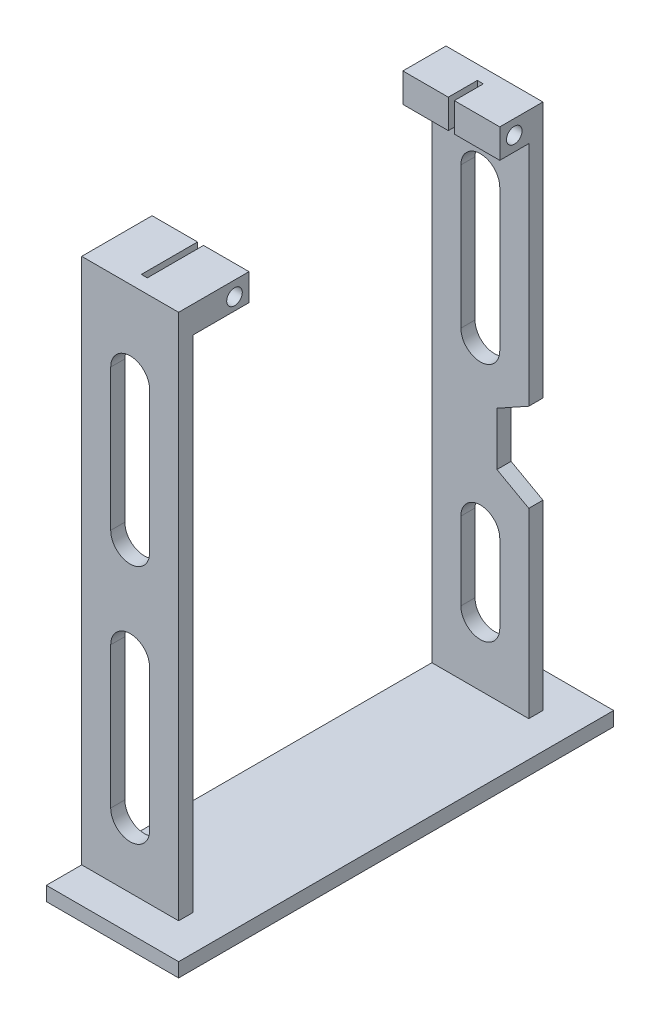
ISO-10303-21;
HEADER;
FILE_DESCRIPTION(('STEP AP214'),'2;1');
FILE_NAME('part.step','',(''),(''),'','','');
FILE_SCHEMA(('AUTOMOTIVE_DESIGN { 1 0 10303 214 1 1 1 1 }'));
ENDSEC;
DATA;
#1=APPLICATION_CONTEXT('core data for automotive mechanical design processes');
#2=APPLICATION_PROTOCOL_DEFINITION('international standard','automotive_design',2000,#1);
#3=PRODUCT_CONTEXT('',#1,'mechanical');
#4=PRODUCT('Part','Part','',(#3));
#5=PRODUCT_RELATED_PRODUCT_CATEGORY('part','',(#4));
#6=PRODUCT_DEFINITION_FORMATION('','',#4);
#7=PRODUCT_DEFINITION_CONTEXT('part definition',#1,'design');
#8=PRODUCT_DEFINITION('design','',#6,#7);
#9=PRODUCT_DEFINITION_SHAPE('','',#8);
#10=(LENGTH_UNIT() NAMED_UNIT(*) SI_UNIT(.MILLI.,.METRE.));
#11=(NAMED_UNIT(*) PLANE_ANGLE_UNIT() SI_UNIT($,.RADIAN.));
#12=(NAMED_UNIT(*) SI_UNIT($,.STERADIAN.) SOLID_ANGLE_UNIT());
#13=UNCERTAINTY_MEASURE_WITH_UNIT(LENGTH_MEASURE(1.E-05),#10,'distance_accuracy_value','');
#14=(GEOMETRIC_REPRESENTATION_CONTEXT(3) GLOBAL_UNCERTAINTY_ASSIGNED_CONTEXT((#13)) GLOBAL_UNIT_ASSIGNED_CONTEXT((#10,
#11,#12)) REPRESENTATION_CONTEXT('',''));
#15=CARTESIAN_POINT('',(0.,0.,0.));
#16=DIRECTION('',(0.,0.,1.));
#17=DIRECTION('',(1.,0.,0.));
#18=AXIS2_PLACEMENT_3D('',#15,#16,#17);
#19=CARTESIAN_POINT('',(13.7,2.,49.));
#20=DIRECTION('',(-1.,0.,0.));
#21=DIRECTION('',(0.,0.,1.));
#22=AXIS2_PLACEMENT_3D('',#19,#20,#21);
#23=PLANE('',#22);
#24=CARTESIAN_POINT('',(13.7,146.9,-45.9));
#25=DIRECTION('',(1.,0.,0.));
#26=DIRECTION('',(0.,0.,-1.));
#27=AXIS2_PLACEMENT_3D('',#24,#25,#26);
#28=CIRCLE('',#27,2.19999999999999);
#29=CARTESIAN_POINT('',(13.7,146.9,-48.1));
#30=VERTEX_POINT('',#29);
#31=EDGE_CURVE('E532',#30,#30,#28,.T.);
#32=ORIENTED_EDGE('',*,*,#31,.F.);
#33=EDGE_LOOP('',(#32));
#34=FACE_BOUND('',#33,.T.);
#35=DIRECTION('',(0.,-1.,0.));
#36=VECTOR('',#35,1.);
#37=CARTESIAN_POINT('',(13.7,151.,-50.));
#38=LINE('',#37,#36);
#39=CARTESIAN_POINT('',(13.7,142.8,-50.));
#40=VERTEX_POINT('',#39);
#41=CARTESIAN_POINT('',(13.7,78.5,-50.));
#42=VERTEX_POINT('',#41);
#43=EDGE_CURVE('E698',#40,#42,#38,.T.);
#44=ORIENTED_EDGE('',*,*,#43,.T.);
#45=DIRECTION('',(0.,0.,-1.));
#46=VECTOR('',#45,1.);
#47=CARTESIAN_POINT('',(13.7,78.5,-40.));
#48=LINE('',#47,#46);
#49=CARTESIAN_POINT('',(13.7,78.5,-54.));
#50=VERTEX_POINT('',#49);
#51=EDGE_CURVE('E460',#42,#50,#48,.T.);
#52=ORIENTED_EDGE('',*,*,#51,.T.);
#53=DIRECTION('',(0.,-1.,0.));
#54=VECTOR('',#53,1.);
#55=CARTESIAN_POINT('',(13.7,2.,-54.));
#56=LINE('',#55,#54);
#57=CARTESIAN_POINT('',(13.7,151.,-54.));
#58=VERTEX_POINT('',#57);
#59=EDGE_CURVE('E734',#58,#50,#56,.T.);
#60=ORIENTED_EDGE('',*,*,#59,.F.);
#61=DIRECTION('',(0.,0.,-1.));
#62=VECTOR('',#61,1.);
#63=CARTESIAN_POINT('',(13.7,151.,-50.));
#64=LINE('',#63,#62);
#65=CARTESIAN_POINT('',(13.7,151.,-41.8));
#66=VERTEX_POINT('',#65);
#67=EDGE_CURVE('E690',#66,#58,#64,.T.);
#68=ORIENTED_EDGE('',*,*,#67,.F.);
#69=DIRECTION('',(0.,-1.,0.));
#70=VECTOR('',#69,1.);
#71=CARTESIAN_POINT('',(13.7,151.,-41.8));
#72=LINE('',#71,#70);
#73=CARTESIAN_POINT('',(13.7,142.8,-41.8));
#74=VERTEX_POINT('',#73);
#75=EDGE_CURVE('E592',#66,#74,#72,.T.);
#76=ORIENTED_EDGE('',*,*,#75,.T.);
#77=DIRECTION('',(0.,0.,-1.));
#78=VECTOR('',#77,1.);
#79=CARTESIAN_POINT('',(13.7,142.8,-41.8));
#80=LINE('',#79,#78);
#81=EDGE_CURVE('E604',#74,#40,#80,.T.);
#82=ORIENTED_EDGE('',*,*,#81,.T.);
#83=EDGE_LOOP('',(#44,#52,#60,#68,#76,#82));
#84=FACE_BOUND('',#83,.T.);
#85=ADVANCED_FACE('F45',(#34,#84),#23,.F.);
#86=CARTESIAN_POINT('',(13.7,53.5,-54.));
#87=VERTEX_POINT('',#86);
#88=CARTESIAN_POINT('',(13.7,2.,-54.));
#89=VERTEX_POINT('',#88);
#90=EDGE_CURVE('E733',#87,#89,#56,.T.);
#91=ORIENTED_EDGE('',*,*,#90,.F.);
#92=DIRECTION('',(0.,0.,-1.));
#93=VECTOR('',#92,1.);
#94=CARTESIAN_POINT('',(13.7,53.5,-40.));
#95=LINE('',#94,#93);
#96=CARTESIAN_POINT('',(13.7,53.5,-50.));
#97=VERTEX_POINT('',#96);
#98=EDGE_CURVE('E459',#97,#87,#95,.T.);
#99=ORIENTED_EDGE('',*,*,#98,.F.);
#100=CARTESIAN_POINT('',(13.7,2.,-50.));
#101=VERTEX_POINT('',#100);
#102=EDGE_CURVE('E694',#97,#101,#38,.T.);
#103=ORIENTED_EDGE('',*,*,#102,.T.);
#104=DIRECTION('',(0.,0.,1.));
#105=VECTOR('',#104,1.);
#106=CARTESIAN_POINT('',(13.7,2.00000000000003,-64.));
#107=LINE('',#106,#105);
#108=EDGE_CURVE('E478',#89,#101,#107,.T.);
#109=ORIENTED_EDGE('',*,*,#108,.F.);
#110=EDGE_LOOP('',(#91,#99,#103,#109));
#111=FACE_BOUND('',#110,.T.);
#112=ADVANCED_FACE('F858',(#111),#23,.F.);
#113=CARTESIAN_POINT('',(13.7,146.9,33.2));
#114=DIRECTION('',(1.,0.,0.));
#115=DIRECTION('',(0.,0.,-1.));
#116=AXIS2_PLACEMENT_3D('',#113,#114,#115);
#117=CIRCLE('',#116,2.20000000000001);
#118=CARTESIAN_POINT('',(13.7,146.9,31.));
#119=VERTEX_POINT('',#118);
#120=EDGE_CURVE('E545',#119,#119,#117,.T.);
#121=ORIENTED_EDGE('',*,*,#120,.F.);
#122=EDGE_LOOP('',(#121));
#123=FACE_BOUND('',#122,.T.);
#124=CARTESIAN_POINT('',(13.7,2.,45.));
#125=VERTEX_POINT('',#124);
#126=CARTESIAN_POINT('',(13.7,2.00000000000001,49.));
#127=VERTEX_POINT('',#126);
#128=EDGE_CURVE('E483',#125,#127,#107,.T.);
#129=ORIENTED_EDGE('',*,*,#128,.F.);
#130=DIRECTION('',(0.,-1.,0.));
#131=VECTOR('',#130,1.);
#132=CARTESIAN_POINT('',(13.7,151.,45.));
#133=LINE('',#132,#131);
#134=CARTESIAN_POINT('',(13.7,143.4,45.));
#135=VERTEX_POINT('',#134);
#136=EDGE_CURVE('E725',#135,#125,#133,.T.);
#137=ORIENTED_EDGE('',*,*,#136,.F.);
#138=DIRECTION('',(0.,0.,1.));
#139=VECTOR('',#138,1.);
#140=CARTESIAN_POINT('',(13.7,143.4,29.1));
#141=LINE('',#140,#139);
#142=CARTESIAN_POINT('',(13.7,143.4,29.1));
#143=VERTEX_POINT('',#142);
#144=EDGE_CURVE('E636',#143,#135,#141,.T.);
#145=ORIENTED_EDGE('',*,*,#144,.F.);
#146=DIRECTION('',(0.,1.,0.));
#147=VECTOR('',#146,1.);
#148=CARTESIAN_POINT('',(13.7,151.,29.1));
#149=LINE('',#148,#147);
#150=CARTESIAN_POINT('',(13.7,151.,29.1));
#151=VERTEX_POINT('',#150);
#152=EDGE_CURVE('E631',#143,#151,#149,.T.);
#153=ORIENTED_EDGE('',*,*,#152,.T.);
#154=DIRECTION('',(0.,0.,-1.));
#155=VECTOR('',#154,1.);
#156=CARTESIAN_POINT('',(13.7,151.,45.));
#157=LINE('',#156,#155);
#158=CARTESIAN_POINT('',(13.7,151.,49.));
#159=VERTEX_POINT('',#158);
#160=EDGE_CURVE('E709',#159,#151,#157,.T.);
#161=ORIENTED_EDGE('',*,*,#160,.F.);
#162=DIRECTION('',(0.,-1.,0.));
#163=VECTOR('',#162,1.);
#164=CARTESIAN_POINT('',(13.7,2.,49.));
#165=LINE('',#164,#163);
#166=EDGE_CURVE('E738',#159,#127,#165,.T.);
#167=ORIENTED_EDGE('',*,*,#166,.T.);
#168=EDGE_LOOP('',(#129,#137,#145,#153,#161,#167));
#169=FACE_BOUND('',#168,.T.);
#170=ADVANCED_FACE('F861',(#123,#169),#23,.F.);
#171=CARTESIAN_POINT('',(13.7,2.,-54.));
#172=DIRECTION('',(0.,0.,1.));
#173=DIRECTION('',(1.,0.,0.));
#174=AXIS2_PLACEMENT_3D('',#171,#172,#173);
#175=PLANE('',#174);
#176=DIRECTION('',(0.,-1.,0.));
#177=VECTOR('',#176,1.);
#178=CARTESIAN_POINT('',(5.5,41.9866034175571,-54.));
#179=LINE('',#178,#177);
#180=CARTESIAN_POINT('',(5.5,41.9866034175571,-54.));
#181=VERTEX_POINT('',#180);
#182=CARTESIAN_POINT('',(5.5,20.0133965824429,-54.));
#183=VERTEX_POINT('',#182);
#184=EDGE_CURVE('E345',#181,#183,#179,.T.);
#185=ORIENTED_EDGE('',*,*,#184,.F.);
#186=CARTESIAN_POINT('',(0.,41.9866034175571,-54.));
#187=DIRECTION('',(0.,0.,-1.));
#188=DIRECTION('',(-1.,0.,0.));
#189=AXIS2_PLACEMENT_3D('',#186,#187,#188);
#190=CIRCLE('',#189,5.5);
#191=CARTESIAN_POINT('',(-5.5,41.9866034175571,-54.));
#192=VERTEX_POINT('',#191);
#193=EDGE_CURVE('E61',#192,#181,#190,.T.);
#194=ORIENTED_EDGE('',*,*,#193,.F.);
#195=DIRECTION('',(0.,1.,0.));
#196=VECTOR('',#195,1.);
#197=CARTESIAN_POINT('',(-5.5,41.9866034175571,-54.));
#198=LINE('',#197,#196);
#199=CARTESIAN_POINT('',(-5.50000000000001,20.0133965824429,-54.));
#200=VERTEX_POINT('',#199);
#201=EDGE_CURVE('E352',#200,#192,#198,.T.);
#202=ORIENTED_EDGE('',*,*,#201,.F.);
#203=CARTESIAN_POINT('',(0.,20.0133965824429,-54.));
#204=DIRECTION('',(0.,0.,-1.));
#205=DIRECTION('',(-1.,0.,0.));
#206=AXIS2_PLACEMENT_3D('',#203,#204,#205);
#207=CIRCLE('',#206,5.5);
#208=EDGE_CURVE('E334',#183,#200,#207,.T.);
#209=ORIENTED_EDGE('',*,*,#208,.F.);
#210=EDGE_LOOP('',(#185,#194,#202,#209));
#211=FACE_BOUND('',#210,.T.);
#212=DIRECTION('',(0.,-1.,0.));
#213=VECTOR('',#212,1.);
#214=CARTESIAN_POINT('',(5.49999999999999,127.986603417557,-54.));
#215=LINE('',#214,#213);
#216=CARTESIAN_POINT('',(5.49999999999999,127.986603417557,-54.));
#217=VERTEX_POINT('',#216);
#218=CARTESIAN_POINT('',(5.49999999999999,88.0133965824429,-54.));
#219=VERTEX_POINT('',#218);
#220=EDGE_CURVE('E387',#217,#219,#215,.T.);
#221=ORIENTED_EDGE('',*,*,#220,.F.);
#222=CARTESIAN_POINT('',(0.,127.986603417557,-54.));
#223=DIRECTION('',(0.,0.,-1.));
#224=DIRECTION('',(-1.,0.,0.));
#225=AXIS2_PLACEMENT_3D('',#222,#223,#224);
#226=CIRCLE('',#225,5.49999999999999);
#227=CARTESIAN_POINT('',(-5.49999999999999,127.986603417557,-54.));
#228=VERTEX_POINT('',#227);
#229=EDGE_CURVE('E69',#228,#217,#226,.T.);
#230=ORIENTED_EDGE('',*,*,#229,.F.);
#231=DIRECTION('',(0.,1.,0.));
#232=VECTOR('',#231,1.);
#233=CARTESIAN_POINT('',(-5.49999999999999,127.986603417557,-54.));
#234=LINE('',#233,#232);
#235=CARTESIAN_POINT('',(-5.50000000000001,88.0133965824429,-54.));
#236=VERTEX_POINT('',#235);
#237=EDGE_CURVE('E370',#236,#228,#234,.T.);
#238=ORIENTED_EDGE('',*,*,#237,.F.);
#239=CARTESIAN_POINT('',(0.,88.0133965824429,-54.));
#240=DIRECTION('',(0.,0.,-1.));
#241=DIRECTION('',(-1.,0.,0.));
#242=AXIS2_PLACEMENT_3D('',#239,#240,#241);
#243=CIRCLE('',#242,5.50000000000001);
#244=EDGE_CURVE('E383',#219,#236,#243,.T.);
#245=ORIENTED_EDGE('',*,*,#244,.F.);
#246=EDGE_LOOP('',(#221,#230,#238,#245));
#247=FACE_BOUND('',#246,.T.);
#248=ORIENTED_EDGE('',*,*,#59,.T.);
#249=DIRECTION('',(0.874157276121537,0.485642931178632,0.));
#250=VECTOR('',#249,1.);
#251=CARTESIAN_POINT('',(4.7,73.5,-54.));
#252=LINE('',#251,#250);
#253=CARTESIAN_POINT('',(4.7,73.5,-54.));
#254=VERTEX_POINT('',#253);
#255=EDGE_CURVE('E456',#254,#50,#252,.T.);
#256=ORIENTED_EDGE('',*,*,#255,.F.);
#257=DIRECTION('',(0.,1.,0.));
#258=VECTOR('',#257,1.);
#259=CARTESIAN_POINT('',(4.7,58.5,-54.));
#260=LINE('',#259,#258);
#261=CARTESIAN_POINT('',(4.7,58.5,-54.));
#262=VERTEX_POINT('',#261);
#263=EDGE_CURVE('E452',#262,#254,#260,.T.);
#264=ORIENTED_EDGE('',*,*,#263,.F.);
#265=DIRECTION('',(-0.874157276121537,0.485642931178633,0.));
#266=VECTOR('',#265,1.);
#267=CARTESIAN_POINT('',(13.7,53.5,-54.));
#268=LINE('',#267,#266);
#269=EDGE_CURVE('E413',#87,#262,#268,.T.);
#270=ORIENTED_EDGE('',*,*,#269,.F.);
#271=ORIENTED_EDGE('',*,*,#90,.T.);
#272=DIRECTION('',(1.,0.,0.));
#273=VECTOR('',#272,1.);
#274=CARTESIAN_POINT('',(-13.7,2.,-54.));
#275=LINE('',#274,#273);
#276=CARTESIAN_POINT('',(-13.7,2.,-54.));
#277=VERTEX_POINT('',#276);
#278=EDGE_CURVE('E503',#277,#89,#275,.T.);
#279=ORIENTED_EDGE('',*,*,#278,.F.);
#280=DIRECTION('',(0.,-1.,0.));
#281=VECTOR('',#280,1.);
#282=CARTESIAN_POINT('',(-13.7,2.,-54.));
#283=LINE('',#282,#281);
#284=CARTESIAN_POINT('',(-13.7,151.,-54.));
#285=VERTEX_POINT('',#284);
#286=EDGE_CURVE('E746',#285,#277,#283,.T.);
#287=ORIENTED_EDGE('',*,*,#286,.F.);
#288=DIRECTION('',(-1.,0.,0.));
#289=VECTOR('',#288,1.);
#290=CARTESIAN_POINT('',(13.7,151.,-54.));
#291=LINE('',#290,#289);
#292=EDGE_CURVE('E681',#58,#285,#291,.T.);
#293=ORIENTED_EDGE('',*,*,#292,.F.);
#294=EDGE_LOOP('',(#248,#256,#264,#270,#271,#279,#287,#293));
#295=FACE_BOUND('',#294,.T.);
#296=ADVANCED_FACE('F47',(#211,#247,#295),#175,.F.);
#297=CARTESIAN_POINT('',(0.,2.,0.));
#298=DIRECTION('',(0.,1.,0.));
#299=DIRECTION('',(0.,0.,1.));
#300=AXIS2_PLACEMENT_3D('',#297,#298,#299);
#301=PLANE('',#300);
#302=DIRECTION('',(-1.,0.,0.));
#303=VECTOR('',#302,1.);
#304=CARTESIAN_POINT('',(-13.7,2.,45.));
#305=LINE('',#304,#303);
#306=CARTESIAN_POINT('',(-13.7,2.,45.));
#307=VERTEX_POINT('',#306);
#308=EDGE_CURVE('E705',#125,#307,#305,.T.);
#309=ORIENTED_EDGE('',*,*,#308,.F.);
#310=ORIENTED_EDGE('',*,*,#128,.T.);
#311=DIRECTION('',(1.,0.,0.));
#312=VECTOR('',#311,1.);
#313=CARTESIAN_POINT('',(-13.7,2.00000000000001,49.));
#314=LINE('',#313,#312);
#315=CARTESIAN_POINT('',(-13.7,2.00000000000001,49.));
#316=VERTEX_POINT('',#315);
#317=EDGE_CURVE('E520',#316,#127,#314,.T.);
#318=ORIENTED_EDGE('',*,*,#317,.F.);
#319=DIRECTION('',(0.,0.,1.));
#320=VECTOR('',#319,1.);
#321=CARTESIAN_POINT('',(-13.7,2.00000000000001,49.));
#322=LINE('',#321,#320);
#323=CARTESIAN_POINT('',(-13.7,2.00000000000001,59.));
#324=VERTEX_POINT('',#323);
#325=EDGE_CURVE('E507',#316,#324,#322,.T.);
#326=ORIENTED_EDGE('',*,*,#325,.T.);
#327=DIRECTION('',(1.,0.,0.));
#328=VECTOR('',#327,1.);
#329=CARTESIAN_POINT('',(-13.7,2.00000000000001,59.));
#330=LINE('',#329,#328);
#331=CARTESIAN_POINT('',(23.7,2.00000000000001,59.));
#332=VERTEX_POINT('',#331);
#333=EDGE_CURVE('E525',#324,#332,#330,.T.);
#334=ORIENTED_EDGE('',*,*,#333,.T.);
#335=DIRECTION('',(0.,0.,-1.));
#336=VECTOR('',#335,1.);
#337=CARTESIAN_POINT('',(23.7,2.00000000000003,-64.));
#338=LINE('',#337,#336);
#339=CARTESIAN_POINT('',(23.7,2.00000000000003,-64.));
#340=VERTEX_POINT('',#339);
#341=EDGE_CURVE('E464',#332,#340,#338,.T.);
#342=ORIENTED_EDGE('',*,*,#341,.T.);
#343=DIRECTION('',(1.,0.,0.));
#344=VECTOR('',#343,1.);
#345=CARTESIAN_POINT('',(-13.7,2.,-64.));
#346=LINE('',#345,#344);
#347=CARTESIAN_POINT('',(-13.7,2.,-64.));
#348=VERTEX_POINT('',#347);
#349=EDGE_CURVE('E508',#348,#340,#346,.T.);
#350=ORIENTED_EDGE('',*,*,#349,.F.);
#351=DIRECTION('',(0.,0.,1.));
#352=VECTOR('',#351,1.);
#353=CARTESIAN_POINT('',(-13.7,2.,-54.));
#354=LINE('',#353,#352);
#355=EDGE_CURVE('E498',#348,#277,#354,.T.);
#356=ORIENTED_EDGE('',*,*,#355,.T.);
#357=ORIENTED_EDGE('',*,*,#278,.T.);
#358=ORIENTED_EDGE('',*,*,#108,.T.);
#359=DIRECTION('',(1.,0.,0.));
#360=VECTOR('',#359,1.);
#361=CARTESIAN_POINT('',(-13.7,2.,-50.));
#362=LINE('',#361,#360);
#363=CARTESIAN_POINT('',(-13.7,2.,-50.));
#364=VERTEX_POINT('',#363);
#365=EDGE_CURVE('E680',#364,#101,#362,.T.);
#366=ORIENTED_EDGE('',*,*,#365,.F.);
#367=DIRECTION('',(0.,0.,1.));
#368=VECTOR('',#367,1.);
#369=CARTESIAN_POINT('',(-13.7,2.,-54.));
#370=LINE('',#369,#368);
#371=EDGE_CURVE('E729',#364,#307,#370,.T.);
#372=ORIENTED_EDGE('',*,*,#371,.T.);
#373=EDGE_LOOP('',(#309,#310,#318,#326,#334,#342,#350,#356,#357,#358,#366,#372));
#374=FACE_BOUND('',#373,.T.);
#375=ADVANCED_FACE('F875',(#374),#301,.T.);
#376=CARTESIAN_POINT('',(-13.7,2.,-54.));
#377=DIRECTION('',(1.,0.,0.));
#378=DIRECTION('',(0.,0.,-1.));
#379=AXIS2_PLACEMENT_3D('',#376,#377,#378);
#380=PLANE('',#379);
#381=CARTESIAN_POINT('',(-13.7,146.9,-45.9));
#382=DIRECTION('',(1.,0.,0.));
#383=DIRECTION('',(0.,0.,-1.));
#384=AXIS2_PLACEMENT_3D('',#381,#382,#383);
#385=CIRCLE('',#384,2.19999999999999);
#386=CARTESIAN_POINT('',(-13.7,146.9,-48.1));
#387=VERTEX_POINT('',#386);
#388=EDGE_CURVE('E541',#387,#387,#385,.T.);
#389=ORIENTED_EDGE('',*,*,#388,.T.);
#390=EDGE_LOOP('',(#389));
#391=FACE_BOUND('',#390,.T.);
#392=CARTESIAN_POINT('',(-13.7,146.9,33.2));
#393=DIRECTION('',(1.,0.,0.));
#394=DIRECTION('',(0.,0.,-1.));
#395=AXIS2_PLACEMENT_3D('',#392,#393,#394);
#396=CIRCLE('',#395,2.20000000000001);
#397=CARTESIAN_POINT('',(-13.7,146.9,31.));
#398=VERTEX_POINT('',#397);
#399=EDGE_CURVE('E554',#398,#398,#396,.T.);
#400=ORIENTED_EDGE('',*,*,#399,.T.);
#401=EDGE_LOOP('',(#400));
#402=FACE_BOUND('',#401,.T.);
#403=DIRECTION('',(0.,-1.,0.));
#404=VECTOR('',#403,1.);
#405=CARTESIAN_POINT('',(-13.7,151.,-50.));
#406=LINE('',#405,#404);
#407=CARTESIAN_POINT('',(-13.7,142.8,-50.));
#408=VERTEX_POINT('',#407);
#409=EDGE_CURVE('E702',#408,#364,#406,.T.);
#410=ORIENTED_EDGE('',*,*,#409,.F.);
#411=DIRECTION('',(0.,0.,-1.));
#412=VECTOR('',#411,1.);
#413=CARTESIAN_POINT('',(-13.7,142.8,-41.8));
#414=LINE('',#413,#412);
#415=CARTESIAN_POINT('',(-13.7,142.8,-41.8));
#416=VERTEX_POINT('',#415);
#417=EDGE_CURVE('E575',#416,#408,#414,.T.);
#418=ORIENTED_EDGE('',*,*,#417,.F.);
#419=DIRECTION('',(0.,1.,0.));
#420=VECTOR('',#419,1.);
#421=CARTESIAN_POINT('',(-13.7,151.,-41.8));
#422=LINE('',#421,#420);
#423=CARTESIAN_POINT('',(-13.7,151.,-41.8));
#424=VERTEX_POINT('',#423);
#425=EDGE_CURVE('E570',#416,#424,#422,.T.);
#426=ORIENTED_EDGE('',*,*,#425,.T.);
#427=DIRECTION('',(0.,0.,1.));
#428=VECTOR('',#427,1.);
#429=CARTESIAN_POINT('',(-13.7,151.,-54.));
#430=LINE('',#429,#428);
#431=EDGE_CURVE('E684',#285,#424,#430,.T.);
#432=ORIENTED_EDGE('',*,*,#431,.F.);
#433=ORIENTED_EDGE('',*,*,#286,.T.);
#434=ORIENTED_EDGE('',*,*,#355,.F.);
#435=DIRECTION('',(0.,1.,0.));
#436=VECTOR('',#435,1.);
#437=CARTESIAN_POINT('',(-13.7,2.,-64.));
#438=LINE('',#437,#436);
#439=CARTESIAN_POINT('',(-13.7,-2.,-64.));
#440=VERTEX_POINT('',#439);
#441=EDGE_CURVE('E491',#440,#348,#438,.T.);
#442=ORIENTED_EDGE('',*,*,#441,.F.);
#443=DIRECTION('',(0.,0.,1.));
#444=VECTOR('',#443,1.);
#445=CARTESIAN_POINT('',(-13.7,-1.99999999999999,49.));
#446=LINE('',#445,#444);
#447=CARTESIAN_POINT('',(-13.7,-1.99999999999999,59.));
#448=VERTEX_POINT('',#447);
#449=EDGE_CURVE('E524',#440,#448,#446,.T.);
#450=ORIENTED_EDGE('',*,*,#449,.T.);
#451=DIRECTION('',(0.,-1.,0.));
#452=VECTOR('',#451,1.);
#453=CARTESIAN_POINT('',(-13.7,2.00000000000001,59.));
#454=LINE('',#453,#452);
#455=EDGE_CURVE('E516',#324,#448,#454,.T.);
#456=ORIENTED_EDGE('',*,*,#455,.F.);
#457=ORIENTED_EDGE('',*,*,#325,.F.);
#458=DIRECTION('',(0.,-1.,0.));
#459=VECTOR('',#458,1.);
#460=CARTESIAN_POINT('',(-13.7,2.,49.));
#461=LINE('',#460,#459);
#462=CARTESIAN_POINT('',(-13.7,151.,49.));
#463=VERTEX_POINT('',#462);
#464=EDGE_CURVE('E742',#463,#316,#461,.T.);
#465=ORIENTED_EDGE('',*,*,#464,.F.);
#466=DIRECTION('',(0.,0.,1.));
#467=VECTOR('',#466,1.);
#468=CARTESIAN_POINT('',(-13.7,151.,49.));
#469=LINE('',#468,#467);
#470=CARTESIAN_POINT('',(-13.7,151.,29.1));
#471=VERTEX_POINT('',#470);
#472=EDGE_CURVE('E715',#471,#463,#469,.T.);
#473=ORIENTED_EDGE('',*,*,#472,.F.);
#474=DIRECTION('',(0.,-1.,0.));
#475=VECTOR('',#474,1.);
#476=CARTESIAN_POINT('',(-13.7,151.,29.1));
#477=LINE('',#476,#475);
#478=CARTESIAN_POINT('',(-13.7,143.4,29.1));
#479=VERTEX_POINT('',#478);
#480=EDGE_CURVE('E653',#471,#479,#477,.T.);
#481=ORIENTED_EDGE('',*,*,#480,.T.);
#482=DIRECTION('',(0.,0.,1.));
#483=VECTOR('',#482,1.);
#484=CARTESIAN_POINT('',(-13.7,143.4,29.1));
#485=LINE('',#484,#483);
#486=CARTESIAN_POINT('',(-13.7,143.4,45.));
#487=VERTEX_POINT('',#486);
#488=EDGE_CURVE('E665',#479,#487,#485,.T.);
#489=ORIENTED_EDGE('',*,*,#488,.T.);
#490=DIRECTION('',(0.,-1.,0.));
#491=VECTOR('',#490,1.);
#492=CARTESIAN_POINT('',(-13.7,151.,45.));
#493=LINE('',#492,#491);
#494=EDGE_CURVE('E719',#487,#307,#493,.T.);
#495=ORIENTED_EDGE('',*,*,#494,.T.);
#496=ORIENTED_EDGE('',*,*,#371,.F.);
#497=EDGE_LOOP('',(#410,#418,#426,#432,#433,#434,#442,#450,#456,#457,#465,#473,#481,#489,#495,#496));
#498=FACE_BOUND('',#497,.T.);
#499=ADVANCED_FACE('F893',(#391,#402,#498),#380,.F.);
#500=CARTESIAN_POINT('',(-13.7,2.,49.));
#501=DIRECTION('',(0.,0.,-1.));
#502=DIRECTION('',(-1.,0.,0.));
#503=AXIS2_PLACEMENT_3D('',#500,#501,#502);
#504=PLANE('',#503);
#505=DIRECTION('',(0.,1.,0.));
#506=VECTOR('',#505,1.);
#507=CARTESIAN_POINT('',(5.5,20.0133965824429,49.));
#508=LINE('',#507,#506);
#509=CARTESIAN_POINT('',(5.5,20.0133965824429,49.));
#510=VERTEX_POINT('',#509);
#511=CARTESIAN_POINT('',(5.49999999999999,59.9866034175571,49.));
#512=VERTEX_POINT('',#511);
#513=EDGE_CURVE('E396',#510,#512,#508,.T.);
#514=ORIENTED_EDGE('',*,*,#513,.F.);
#515=CARTESIAN_POINT('',(0.,20.0133965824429,49.));
#516=DIRECTION('',(0.,0.,1.));
#517=DIRECTION('',(1.,0.,0.));
#518=AXIS2_PLACEMENT_3D('',#515,#516,#517);
#519=CIRCLE('',#518,5.5);
#520=CARTESIAN_POINT('',(-5.5,20.0133965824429,49.));
#521=VERTEX_POINT('',#520);
#522=EDGE_CURVE('E393',#521,#510,#519,.T.);
#523=ORIENTED_EDGE('',*,*,#522,.F.);
#524=DIRECTION('',(0.,-1.,0.));
#525=VECTOR('',#524,1.);
#526=CARTESIAN_POINT('',(-5.5,20.0133965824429,49.));
#527=LINE('',#526,#525);
#528=CARTESIAN_POINT('',(-5.50000000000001,59.9866034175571,49.));
#529=VERTEX_POINT('',#528);
#530=EDGE_CURVE('E405',#529,#521,#527,.T.);
#531=ORIENTED_EDGE('',*,*,#530,.F.);
#532=CARTESIAN_POINT('',(0.,59.9866034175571,49.));
#533=DIRECTION('',(0.,0.,1.));
#534=DIRECTION('',(1.,0.,0.));
#535=AXIS2_PLACEMENT_3D('',#532,#533,#534);
#536=CIRCLE('',#535,5.5);
#537=EDGE_CURVE('E401',#512,#529,#536,.T.);
#538=ORIENTED_EDGE('',*,*,#537,.F.);
#539=EDGE_LOOP('',(#514,#523,#531,#538));
#540=FACE_BOUND('',#539,.T.);
#541=DIRECTION('',(0.,-1.,0.));
#542=VECTOR('',#541,1.);
#543=CARTESIAN_POINT('',(-5.49999999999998,127.986603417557,49.));
#544=LINE('',#543,#542);
#545=CARTESIAN_POINT('',(-5.49999999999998,127.986603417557,49.));
#546=VERTEX_POINT('',#545);
#547=CARTESIAN_POINT('',(-5.49999999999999,88.0133965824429,49.));
#548=VERTEX_POINT('',#547);
#549=EDGE_CURVE('E443',#546,#548,#544,.T.);
#550=ORIENTED_EDGE('',*,*,#549,.F.);
#551=CARTESIAN_POINT('',(0.,127.986603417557,49.));
#552=DIRECTION('',(0.,0.,1.));
#553=DIRECTION('',(1.,0.,0.));
#554=AXIS2_PLACEMENT_3D('',#551,#552,#553);
#555=CIRCLE('',#554,5.49999999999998);
#556=CARTESIAN_POINT('',(5.49999999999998,127.986603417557,49.));
#557=VERTEX_POINT('',#556);
#558=EDGE_CURVE('E397',#557,#546,#555,.T.);
#559=ORIENTED_EDGE('',*,*,#558,.F.);
#560=DIRECTION('',(0.,1.,0.));
#561=VECTOR('',#560,1.);
#562=CARTESIAN_POINT('',(5.49999999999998,127.986603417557,49.));
#563=LINE('',#562,#561);
#564=CARTESIAN_POINT('',(5.49999999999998,88.0133965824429,49.));
#565=VERTEX_POINT('',#564);
#566=EDGE_CURVE('E427',#565,#557,#563,.T.);
#567=ORIENTED_EDGE('',*,*,#566,.F.);
#568=CARTESIAN_POINT('',(0.,88.0133965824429,49.));
#569=DIRECTION('',(0.,0.,1.));
#570=DIRECTION('',(1.,0.,0.));
#571=AXIS2_PLACEMENT_3D('',#568,#569,#570);
#572=CIRCLE('',#571,5.49999999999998);
#573=EDGE_CURVE('E439',#548,#565,#572,.T.);
#574=ORIENTED_EDGE('',*,*,#573,.F.);
#575=EDGE_LOOP('',(#550,#559,#567,#574));
#576=FACE_BOUND('',#575,.T.);
#577=ORIENTED_EDGE('',*,*,#464,.T.);
#578=ORIENTED_EDGE('',*,*,#317,.T.);
#579=ORIENTED_EDGE('',*,*,#166,.F.);
#580=DIRECTION('',(1.,0.,0.));
#581=VECTOR('',#580,1.);
#582=CARTESIAN_POINT('',(13.7,151.,49.));
#583=LINE('',#582,#581);
#584=EDGE_CURVE('E706',#463,#159,#583,.T.);
#585=ORIENTED_EDGE('',*,*,#584,.F.);
#586=EDGE_LOOP('',(#577,#578,#579,#585));
#587=FACE_BOUND('',#586,.T.);
#588=ADVANCED_FACE('F911',(#540,#576,#587),#504,.F.);
#589=CARTESIAN_POINT('',(-13.7,151.,45.));
#590=DIRECTION('',(0.,0.,1.));
#591=DIRECTION('',(1.,0.,0.));
#592=AXIS2_PLACEMENT_3D('',#589,#590,#591);
#593=PLANE('',#592);
#594=DIRECTION('',(0.,-1.,0.));
#595=VECTOR('',#594,1.);
#596=CARTESIAN_POINT('',(-5.50000000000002,151.,45.));
#597=LINE('',#596,#595);
#598=CARTESIAN_POINT('',(-5.50000000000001,59.9866034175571,45.));
#599=VERTEX_POINT('',#598);
#600=CARTESIAN_POINT('',(-5.5,20.0133965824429,45.));
#601=VERTEX_POINT('',#600);
#602=EDGE_CURVE('E807',#599,#601,#597,.T.);
#603=ORIENTED_EDGE('',*,*,#602,.T.);
#604=CARTESIAN_POINT('',(0.,20.0133965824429,45.));
#605=DIRECTION('',(0.,0.,1.));
#606=DIRECTION('',(1.,0.,0.));
#607=AXIS2_PLACEMENT_3D('',#604,#605,#606);
#608=CIRCLE('',#607,5.5);
#609=CARTESIAN_POINT('',(5.5,20.0133965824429,45.));
#610=VERTEX_POINT('',#609);
#611=EDGE_CURVE('E811',#601,#610,#608,.T.);
#612=ORIENTED_EDGE('',*,*,#611,.T.);
#613=DIRECTION('',(0.,1.,0.));
#614=VECTOR('',#613,1.);
#615=CARTESIAN_POINT('',(5.49999999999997,151.,45.));
#616=LINE('',#615,#614);
#617=CARTESIAN_POINT('',(5.49999999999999,59.9866034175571,45.));
#618=VERTEX_POINT('',#617);
#619=EDGE_CURVE('E799',#610,#618,#616,.T.);
#620=ORIENTED_EDGE('',*,*,#619,.T.);
#621=CARTESIAN_POINT('',(0.,59.9866034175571,45.));
#622=DIRECTION('',(0.,0.,1.));
#623=DIRECTION('',(1.,0.,0.));
#624=AXIS2_PLACEMENT_3D('',#621,#622,#623);
#625=CIRCLE('',#624,5.5);
#626=EDGE_CURVE('E803',#618,#599,#625,.T.);
#627=ORIENTED_EDGE('',*,*,#626,.T.);
#628=EDGE_LOOP('',(#603,#612,#620,#627));
#629=FACE_BOUND('',#628,.T.);
#630=DIRECTION('',(0.,1.,0.));
#631=VECTOR('',#630,1.);
#632=CARTESIAN_POINT('',(5.49999999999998,151.,45.));
#633=LINE('',#632,#631);
#634=CARTESIAN_POINT('',(5.49999999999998,88.0133965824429,45.));
#635=VERTEX_POINT('',#634);
#636=CARTESIAN_POINT('',(5.49999999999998,127.986603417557,45.));
#637=VERTEX_POINT('',#636);
#638=EDGE_CURVE('E791',#635,#637,#633,.T.);
#639=ORIENTED_EDGE('',*,*,#638,.T.);
#640=CARTESIAN_POINT('',(0.,127.986603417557,45.));
#641=DIRECTION('',(0.,0.,1.));
#642=DIRECTION('',(1.,0.,0.));
#643=AXIS2_PLACEMENT_3D('',#640,#641,#642);
#644=CIRCLE('',#643,5.49999999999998);
#645=CARTESIAN_POINT('',(-5.49999999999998,127.986603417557,45.));
#646=VERTEX_POINT('',#645);
#647=EDGE_CURVE('E795',#637,#646,#644,.T.);
#648=ORIENTED_EDGE('',*,*,#647,.T.);
#649=DIRECTION('',(0.,-1.,0.));
#650=VECTOR('',#649,1.);
#651=CARTESIAN_POINT('',(-5.49999999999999,151.,45.));
#652=LINE('',#651,#650);
#653=CARTESIAN_POINT('',(-5.49999999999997,88.0133965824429,45.));
#654=VERTEX_POINT('',#653);
#655=EDGE_CURVE('E783',#646,#654,#652,.T.);
#656=ORIENTED_EDGE('',*,*,#655,.T.);
#657=CARTESIAN_POINT('',(0.,88.0133965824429,45.));
#658=DIRECTION('',(0.,0.,1.));
#659=DIRECTION('',(1.,0.,0.));
#660=AXIS2_PLACEMENT_3D('',#657,#658,#659);
#661=CIRCLE('',#660,5.49999999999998);
#662=EDGE_CURVE('E787',#654,#635,#661,.T.);
#663=ORIENTED_EDGE('',*,*,#662,.T.);
#664=EDGE_LOOP('',(#639,#648,#656,#663));
#665=FACE_BOUND('',#664,.T.);
#666=DIRECTION('',(0.,-1.,0.));
#667=VECTOR('',#666,1.);
#668=CARTESIAN_POINT('',(0.849999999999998,151.,45.));
#669=LINE('',#668,#667);
#670=CARTESIAN_POINT('',(0.849999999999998,151.,45.));
#671=VERTEX_POINT('',#670);
#672=CARTESIAN_POINT('',(0.849999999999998,143.4,45.));
#673=VERTEX_POINT('',#672);
#674=EDGE_CURVE('E639',#671,#673,#669,.T.);
#675=ORIENTED_EDGE('',*,*,#674,.T.);
#676=DIRECTION('',(1.,0.,0.));
#677=VECTOR('',#676,1.);
#678=CARTESIAN_POINT('',(-13.7,143.4,45.));
#679=LINE('',#678,#677);
#680=EDGE_CURVE('E754',#673,#135,#679,.T.);
#681=ORIENTED_EDGE('',*,*,#680,.T.);
#682=ORIENTED_EDGE('',*,*,#136,.T.);
#683=ORIENTED_EDGE('',*,*,#308,.T.);
#684=ORIENTED_EDGE('',*,*,#494,.F.);
#685=DIRECTION('',(1.,0.,0.));
#686=VECTOR('',#685,1.);
#687=CARTESIAN_POINT('',(-13.7,143.4,45.));
#688=LINE('',#687,#686);
#689=CARTESIAN_POINT('',(-0.850000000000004,143.4,45.));
#690=VERTEX_POINT('',#689);
#691=EDGE_CURVE('E750',#487,#690,#688,.T.);
#692=ORIENTED_EDGE('',*,*,#691,.T.);
#693=DIRECTION('',(0.,1.,0.));
#694=VECTOR('',#693,1.);
#695=CARTESIAN_POINT('',(-0.850000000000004,151.,45.));
#696=LINE('',#695,#694);
#697=CARTESIAN_POINT('',(-0.850000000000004,151.,45.));
#698=VERTEX_POINT('',#697);
#699=EDGE_CURVE('E670',#690,#698,#696,.T.);
#700=ORIENTED_EDGE('',*,*,#699,.T.);
#701=DIRECTION('',(-1.,0.,0.));
#702=VECTOR('',#701,1.);
#703=CARTESIAN_POINT('',(-13.7,151.,45.));
#704=LINE('',#703,#702);
#705=EDGE_CURVE('E712',#671,#698,#704,.T.);
#706=ORIENTED_EDGE('',*,*,#705,.F.);
#707=EDGE_LOOP('',(#675,#681,#682,#683,#684,#692,#700,#706));
#708=FACE_BOUND('',#707,.T.);
#709=ADVANCED_FACE('F886',(#629,#665,#708),#593,.F.);
#710=CARTESIAN_POINT('',(0.,151.,0.));
#711=DIRECTION('',(0.,-1.,0.));
#712=DIRECTION('',(0.,0.,-1.));
#713=AXIS2_PLACEMENT_3D('',#710,#711,#712);
#714=PLANE('',#713);
#715=ORIENTED_EDGE('',*,*,#584,.T.);
#716=ORIENTED_EDGE('',*,*,#160,.T.);
#717=DIRECTION('',(-1.,0.,0.));
#718=VECTOR('',#717,1.);
#719=CARTESIAN_POINT('',(0.849999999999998,151.,29.1));
#720=LINE('',#719,#718);
#721=CARTESIAN_POINT('',(0.849999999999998,151.,29.1));
#722=VERTEX_POINT('',#721);
#723=EDGE_CURVE('E619',#151,#722,#720,.T.);
#724=ORIENTED_EDGE('',*,*,#723,.T.);
#725=DIRECTION('',(0.,0.,1.));
#726=VECTOR('',#725,1.);
#727=CARTESIAN_POINT('',(0.849999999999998,151.,29.1));
#728=LINE('',#727,#726);
#729=EDGE_CURVE('E635',#722,#671,#728,.T.);
#730=ORIENTED_EDGE('',*,*,#729,.T.);
#731=ORIENTED_EDGE('',*,*,#705,.T.);
#732=DIRECTION('',(0.,0.,1.));
#733=VECTOR('',#732,1.);
#734=CARTESIAN_POINT('',(-0.850000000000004,151.,29.1));
#735=LINE('',#734,#733);
#736=CARTESIAN_POINT('',(-0.850000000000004,151.,29.1));
#737=VERTEX_POINT('',#736);
#738=EDGE_CURVE('E666',#737,#698,#735,.T.);
#739=ORIENTED_EDGE('',*,*,#738,.F.);
#740=DIRECTION('',(-1.,0.,0.));
#741=VECTOR('',#740,1.);
#742=CARTESIAN_POINT('',(-0.850000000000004,151.,29.1));
#743=LINE('',#742,#741);
#744=EDGE_CURVE('E649',#737,#471,#743,.T.);
#745=ORIENTED_EDGE('',*,*,#744,.T.);
#746=ORIENTED_EDGE('',*,*,#472,.T.);
#747=EDGE_LOOP('',(#715,#716,#724,#730,#731,#739,#745,#746));
#748=FACE_BOUND('',#747,.T.);
#749=ADVANCED_FACE('F904',(#748),#714,.F.);
#750=CARTESIAN_POINT('',(-13.7,151.,-50.));
#751=DIRECTION('',(0.,0.,-1.));
#752=DIRECTION('',(-1.,0.,0.));
#753=AXIS2_PLACEMENT_3D('',#750,#751,#752);
#754=PLANE('',#753);
#755=DIRECTION('',(0.,1.,0.));
#756=VECTOR('',#755,1.);
#757=CARTESIAN_POINT('',(-5.49999999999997,151.,-50.));
#758=LINE('',#757,#756);
#759=CARTESIAN_POINT('',(-5.50000000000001,20.0133965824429,-50.));
#760=VERTEX_POINT('',#759);
#761=CARTESIAN_POINT('',(-5.5,41.9866034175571,-50.));
#762=VERTEX_POINT('',#761);
#763=EDGE_CURVE('E54',#760,#762,#758,.T.);
#764=ORIENTED_EDGE('',*,*,#763,.T.);
#765=CARTESIAN_POINT('',(0.,41.9866034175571,-50.));
#766=DIRECTION('',(0.,0.,-1.));
#767=DIRECTION('',(-1.,0.,0.));
#768=AXIS2_PLACEMENT_3D('',#765,#766,#767);
#769=CIRCLE('',#768,5.5);
#770=CARTESIAN_POINT('',(5.5,41.9866034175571,-50.));
#771=VERTEX_POINT('',#770);
#772=EDGE_CURVE('E11',#762,#771,#769,.T.);
#773=ORIENTED_EDGE('',*,*,#772,.T.);
#774=DIRECTION('',(0.,-1.,0.));
#775=VECTOR('',#774,1.);
#776=CARTESIAN_POINT('',(5.50000000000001,151.,-50.));
#777=LINE('',#776,#775);
#778=CARTESIAN_POINT('',(5.5,20.0133965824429,-50.));
#779=VERTEX_POINT('',#778);
#780=EDGE_CURVE('E831',#771,#779,#777,.T.);
#781=ORIENTED_EDGE('',*,*,#780,.T.);
#782=CARTESIAN_POINT('',(0.,20.0133965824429,-50.));
#783=DIRECTION('',(0.,0.,-1.));
#784=DIRECTION('',(-1.,0.,0.));
#785=AXIS2_PLACEMENT_3D('',#782,#783,#784);
#786=CIRCLE('',#785,5.5);
#787=EDGE_CURVE('E337',#779,#760,#786,.T.);
#788=ORIENTED_EDGE('',*,*,#787,.T.);
#789=EDGE_LOOP('',(#764,#773,#781,#788));
#790=FACE_BOUND('',#789,.T.);
#791=DIRECTION('',(0.,1.,0.));
#792=VECTOR('',#791,1.);
#793=CARTESIAN_POINT('',(-5.49999999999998,151.,-50.));
#794=LINE('',#793,#792);
#795=CARTESIAN_POINT('',(-5.50000000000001,88.0133965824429,-50.));
#796=VERTEX_POINT('',#795);
#797=CARTESIAN_POINT('',(-5.49999999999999,127.986603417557,-50.));
#798=VERTEX_POINT('',#797);
#799=EDGE_CURVE('E823',#796,#798,#794,.T.);
#800=ORIENTED_EDGE('',*,*,#799,.T.);
#801=CARTESIAN_POINT('',(0.,127.986603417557,-50.));
#802=DIRECTION('',(0.,0.,-1.));
#803=DIRECTION('',(-1.,0.,0.));
#804=AXIS2_PLACEMENT_3D('',#801,#802,#803);
#805=CIRCLE('',#804,5.49999999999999);
#806=CARTESIAN_POINT('',(5.49999999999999,127.986603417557,-50.));
#807=VERTEX_POINT('',#806);
#808=EDGE_CURVE('E827',#798,#807,#805,.T.);
#809=ORIENTED_EDGE('',*,*,#808,.T.);
#810=DIRECTION('',(0.,-1.,0.));
#811=VECTOR('',#810,1.);
#812=CARTESIAN_POINT('',(5.49999999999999,151.,-50.));
#813=LINE('',#812,#811);
#814=CARTESIAN_POINT('',(5.50000000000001,88.0133965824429,-50.));
#815=VERTEX_POINT('',#814);
#816=EDGE_CURVE('E815',#807,#815,#813,.T.);
#817=ORIENTED_EDGE('',*,*,#816,.T.);
#818=CARTESIAN_POINT('',(0.,88.0133965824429,-50.));
#819=DIRECTION('',(0.,0.,-1.));
#820=DIRECTION('',(-1.,0.,0.));
#821=AXIS2_PLACEMENT_3D('',#818,#819,#820);
#822=CIRCLE('',#821,5.50000000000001);
#823=EDGE_CURVE('E819',#815,#796,#822,.T.);
#824=ORIENTED_EDGE('',*,*,#823,.T.);
#825=EDGE_LOOP('',(#800,#809,#817,#824));
#826=FACE_BOUND('',#825,.T.);
#827=DIRECTION('',(0.,1.,0.));
#828=VECTOR('',#827,1.);
#829=CARTESIAN_POINT('',(4.7,151.,-50.));
#830=LINE('',#829,#828);
#831=CARTESIAN_POINT('',(4.7,58.5,-50.));
#832=VERTEX_POINT('',#831);
#833=CARTESIAN_POINT('',(4.7,73.5,-50.));
#834=VERTEX_POINT('',#833);
#835=EDGE_CURVE('E775',#832,#834,#830,.T.);
#836=ORIENTED_EDGE('',*,*,#835,.T.);
#837=DIRECTION('',(0.874157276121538,0.485642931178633,0.));
#838=VECTOR('',#837,1.);
#839=CARTESIAN_POINT('',(23.5405660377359,83.9669811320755,-50.));
#840=LINE('',#839,#838);
#841=EDGE_CURVE('E779',#834,#42,#840,.T.);
#842=ORIENTED_EDGE('',*,*,#841,.T.);
#843=ORIENTED_EDGE('',*,*,#43,.F.);
#844=DIRECTION('',(-1.,0.,0.));
#845=VECTOR('',#844,1.);
#846=CARTESIAN_POINT('',(-13.7,142.8,-50.));
#847=LINE('',#846,#845);
#848=CARTESIAN_POINT('',(0.849999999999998,142.8,-50.));
#849=VERTEX_POINT('',#848);
#850=EDGE_CURVE('E758',#40,#849,#847,.T.);
#851=ORIENTED_EDGE('',*,*,#850,.T.);
#852=DIRECTION('',(0.,1.,0.));
#853=VECTOR('',#852,1.);
#854=CARTESIAN_POINT('',(0.849999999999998,151.,-50.));
#855=LINE('',#854,#853);
#856=CARTESIAN_POINT('',(0.849999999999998,151.,-50.));
#857=VERTEX_POINT('',#856);
#858=EDGE_CURVE('E609',#849,#857,#855,.T.);
#859=ORIENTED_EDGE('',*,*,#858,.T.);
#860=DIRECTION('',(1.,0.,0.));
#861=VECTOR('',#860,1.);
#862=CARTESIAN_POINT('',(-13.7,151.,-50.));
#863=LINE('',#862,#861);
#864=CARTESIAN_POINT('',(-0.850000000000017,151.,-50.));
#865=VERTEX_POINT('',#864);
#866=EDGE_CURVE('E687',#865,#857,#863,.T.);
#867=ORIENTED_EDGE('',*,*,#866,.F.);
#868=DIRECTION('',(0.,-1.,0.));
#869=VECTOR('',#868,1.);
#870=CARTESIAN_POINT('',(-0.850000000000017,151.,-50.));
#871=LINE('',#870,#869);
#872=CARTESIAN_POINT('',(-0.850000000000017,142.8,-50.));
#873=VERTEX_POINT('',#872);
#874=EDGE_CURVE('E578',#865,#873,#871,.T.);
#875=ORIENTED_EDGE('',*,*,#874,.T.);
#876=DIRECTION('',(-1.,0.,0.));
#877=VECTOR('',#876,1.);
#878=CARTESIAN_POINT('',(-13.7,142.8,-50.));
#879=LINE('',#878,#877);
#880=EDGE_CURVE('E762',#873,#408,#879,.T.);
#881=ORIENTED_EDGE('',*,*,#880,.T.);
#882=ORIENTED_EDGE('',*,*,#409,.T.);
#883=ORIENTED_EDGE('',*,*,#365,.T.);
#884=ORIENTED_EDGE('',*,*,#102,.F.);
#885=DIRECTION('',(-0.874157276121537,0.485642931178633,0.));
#886=VECTOR('',#885,1.);
#887=CARTESIAN_POINT('',(-48.6292452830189,88.1273584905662,-50.));
#888=LINE('',#887,#886);
#889=EDGE_CURVE('E482',#97,#832,#888,.T.);
#890=ORIENTED_EDGE('',*,*,#889,.T.);
#891=EDGE_LOOP('',(#836,#842,#843,#851,#859,#867,#875,#881,#882,#883,#884,#890));
#892=FACE_BOUND('',#891,.T.);
#893=ADVANCED_FACE('F838',(#790,#826,#892),#754,.F.);
#894=CARTESIAN_POINT('',(0.,151.,0.));
#895=DIRECTION('',(0.,1.,0.));
#896=DIRECTION('',(0.,0.,1.));
#897=AXIS2_PLACEMENT_3D('',#894,#895,#896);
#898=PLANE('',#897);
#899=ORIENTED_EDGE('',*,*,#292,.T.);
#900=ORIENTED_EDGE('',*,*,#431,.T.);
#901=DIRECTION('',(1.,0.,0.));
#902=VECTOR('',#901,1.);
#903=CARTESIAN_POINT('',(-0.850000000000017,151.,-41.8));
#904=LINE('',#903,#902);
#905=CARTESIAN_POINT('',(-0.850000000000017,151.,-41.8));
#906=VERTEX_POINT('',#905);
#907=EDGE_CURVE('E558',#424,#906,#904,.T.);
#908=ORIENTED_EDGE('',*,*,#907,.T.);
#909=DIRECTION('',(0.,0.,-1.));
#910=VECTOR('',#909,1.);
#911=CARTESIAN_POINT('',(-0.850000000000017,151.,-41.8));
#912=LINE('',#911,#910);
#913=EDGE_CURVE('E574',#906,#865,#912,.T.);
#914=ORIENTED_EDGE('',*,*,#913,.T.);
#915=ORIENTED_EDGE('',*,*,#866,.T.);
#916=DIRECTION('',(0.,0.,-1.));
#917=VECTOR('',#916,1.);
#918=CARTESIAN_POINT('',(0.849999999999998,151.,-41.8));
#919=LINE('',#918,#917);
#920=CARTESIAN_POINT('',(0.849999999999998,151.,-41.8));
#921=VERTEX_POINT('',#920);
#922=EDGE_CURVE('E605',#921,#857,#919,.T.);
#923=ORIENTED_EDGE('',*,*,#922,.F.);
#924=DIRECTION('',(1.,0.,0.));
#925=VECTOR('',#924,1.);
#926=CARTESIAN_POINT('',(0.849999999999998,151.,-41.8));
#927=LINE('',#926,#925);
#928=EDGE_CURVE('E588',#921,#66,#927,.T.);
#929=ORIENTED_EDGE('',*,*,#928,.T.);
#930=ORIENTED_EDGE('',*,*,#67,.T.);
#931=EDGE_LOOP('',(#899,#900,#908,#914,#915,#923,#929,#930));
#932=FACE_BOUND('',#931,.T.);
#933=ADVANCED_FACE('F939',(#932),#898,.T.);
#934=CARTESIAN_POINT('',(-13.7,143.4,29.1));
#935=DIRECTION('',(0.,-1.,0.));
#936=DIRECTION('',(0.,0.,-1.));
#937=AXIS2_PLACEMENT_3D('',#934,#935,#936);
#938=PLANE('',#937);
#939=ORIENTED_EDGE('',*,*,#691,.F.);
#940=ORIENTED_EDGE('',*,*,#488,.F.);
#941=DIRECTION('',(1.,0.,0.));
#942=VECTOR('',#941,1.);
#943=CARTESIAN_POINT('',(-13.7,143.4,29.1));
#944=LINE('',#943,#942);
#945=CARTESIAN_POINT('',(-0.850000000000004,143.4,29.1));
#946=VERTEX_POINT('',#945);
#947=EDGE_CURVE('E657',#479,#946,#944,.T.);
#948=ORIENTED_EDGE('',*,*,#947,.T.);
#949=DIRECTION('',(0.,0.,1.));
#950=VECTOR('',#949,1.);
#951=CARTESIAN_POINT('',(-0.850000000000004,143.4,29.1));
#952=LINE('',#951,#950);
#953=EDGE_CURVE('E671',#946,#690,#952,.T.);
#954=ORIENTED_EDGE('',*,*,#953,.T.);
#955=EDGE_LOOP('',(#939,#940,#948,#954));
#956=FACE_BOUND('',#955,.T.);
#957=ADVANCED_FACE('F897',(#956),#938,.T.);
#958=CARTESIAN_POINT('',(-0.850000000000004,143.4,29.1));
#959=DIRECTION('',(1.,0.,0.));
#960=DIRECTION('',(0.,0.,-1.));
#961=AXIS2_PLACEMENT_3D('',#958,#959,#960);
#962=PLANE('',#961);
#963=CARTESIAN_POINT('',(-0.850000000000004,146.9,33.2));
#964=DIRECTION('',(1.,0.,0.));
#965=DIRECTION('',(0.,0.,-1.));
#966=AXIS2_PLACEMENT_3D('',#963,#964,#965);
#967=CIRCLE('',#966,2.20000000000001);
#968=CARTESIAN_POINT('',(-0.850000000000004,146.9,31.));
#969=VERTEX_POINT('',#968);
#970=EDGE_CURVE('E550',#969,#969,#967,.T.);
#971=ORIENTED_EDGE('',*,*,#970,.F.);
#972=EDGE_LOOP('',(#971));
#973=FACE_BOUND('',#972,.T.);
#974=ORIENTED_EDGE('',*,*,#699,.F.);
#975=ORIENTED_EDGE('',*,*,#953,.F.);
#976=DIRECTION('',(0.,1.,0.));
#977=VECTOR('',#976,1.);
#978=CARTESIAN_POINT('',(-0.850000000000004,143.4,29.1));
#979=LINE('',#978,#977);
#980=EDGE_CURVE('E661',#946,#737,#979,.T.);
#981=ORIENTED_EDGE('',*,*,#980,.T.);
#982=ORIENTED_EDGE('',*,*,#738,.T.);
#983=EDGE_LOOP('',(#974,#975,#981,#982));
#984=FACE_BOUND('',#983,.T.);
#985=ADVANCED_FACE('F901',(#973,#984),#962,.T.);
#986=CARTESIAN_POINT('',(0.,0.,29.1));
#987=DIRECTION('',(0.,0.,1.));
#988=DIRECTION('',(1.,0.,0.));
#989=AXIS2_PLACEMENT_3D('',#986,#987,#988);
#990=PLANE('',#989);
#991=ORIENTED_EDGE('',*,*,#744,.F.);
#992=ORIENTED_EDGE('',*,*,#980,.F.);
#993=ORIENTED_EDGE('',*,*,#947,.F.);
#994=ORIENTED_EDGE('',*,*,#480,.F.);
#995=EDGE_LOOP('',(#991,#992,#993,#994));
#996=FACE_BOUND('',#995,.T.);
#997=ADVANCED_FACE('F907',(#996),#990,.F.);
#998=CARTESIAN_POINT('',(13.7,143.4,29.1));
#999=DIRECTION('',(0.,-1.,0.));
#1000=DIRECTION('',(0.,0.,-1.));
#1001=AXIS2_PLACEMENT_3D('',#998,#999,#1000);
#1002=PLANE('',#1001);
#1003=ORIENTED_EDGE('',*,*,#680,.F.);
#1004=DIRECTION('',(0.,0.,1.));
#1005=VECTOR('',#1004,1.);
#1006=CARTESIAN_POINT('',(0.849999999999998,143.4,29.1));
#1007=LINE('',#1006,#1005);
#1008=CARTESIAN_POINT('',(0.849999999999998,143.4,29.1));
#1009=VERTEX_POINT('',#1008);
#1010=EDGE_CURVE('E640',#1009,#673,#1007,.T.);
#1011=ORIENTED_EDGE('',*,*,#1010,.F.);
#1012=DIRECTION('',(1.,0.,0.));
#1013=VECTOR('',#1012,1.);
#1014=CARTESIAN_POINT('',(13.7,143.4,29.1));
#1015=LINE('',#1014,#1013);
#1016=EDGE_CURVE('E627',#1009,#143,#1015,.T.);
#1017=ORIENTED_EDGE('',*,*,#1016,.T.);
#1018=ORIENTED_EDGE('',*,*,#144,.T.);
#1019=EDGE_LOOP('',(#1003,#1011,#1017,#1018));
#1020=FACE_BOUND('',#1019,.T.);
#1021=ADVANCED_FACE('F921',(#1020),#1002,.T.);
#1022=CARTESIAN_POINT('',(0.849999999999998,143.4,29.1));
#1023=DIRECTION('',(-1.,0.,0.));
#1024=DIRECTION('',(0.,0.,1.));
#1025=AXIS2_PLACEMENT_3D('',#1022,#1023,#1024);
#1026=PLANE('',#1025);
#1027=CARTESIAN_POINT('',(0.849999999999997,146.9,33.2));
#1028=DIRECTION('',(-1.,0.,0.));
#1029=DIRECTION('',(0.,0.,1.));
#1030=AXIS2_PLACEMENT_3D('',#1027,#1028,#1029);
#1031=CIRCLE('',#1030,2.20000000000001);
#1032=CARTESIAN_POINT('',(0.849999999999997,146.9,35.4));
#1033=VERTEX_POINT('',#1032);
#1034=EDGE_CURVE('E549',#1033,#1033,#1031,.T.);
#1035=ORIENTED_EDGE('',*,*,#1034,.F.);
#1036=EDGE_LOOP('',(#1035));
#1037=FACE_BOUND('',#1036,.T.);
#1038=ORIENTED_EDGE('',*,*,#674,.F.);
#1039=ORIENTED_EDGE('',*,*,#729,.F.);
#1040=DIRECTION('',(0.,-1.,0.));
#1041=VECTOR('',#1040,1.);
#1042=CARTESIAN_POINT('',(0.849999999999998,143.4,29.1));
#1043=LINE('',#1042,#1041);
#1044=EDGE_CURVE('E623',#722,#1009,#1043,.T.);
#1045=ORIENTED_EDGE('',*,*,#1044,.T.);
#1046=ORIENTED_EDGE('',*,*,#1010,.T.);
#1047=EDGE_LOOP('',(#1038,#1039,#1045,#1046));
#1048=FACE_BOUND('',#1047,.T.);
#1049=ADVANCED_FACE('F919',(#1037,#1048),#1026,.T.);
#1050=CARTESIAN_POINT('',(0.,0.,29.1));
#1051=DIRECTION('',(0.,0.,-1.));
#1052=DIRECTION('',(-1.,0.,0.));
#1053=AXIS2_PLACEMENT_3D('',#1050,#1051,#1052);
#1054=PLANE('',#1053);
#1055=ORIENTED_EDGE('',*,*,#723,.F.);
#1056=ORIENTED_EDGE('',*,*,#152,.F.);
#1057=ORIENTED_EDGE('',*,*,#1016,.F.);
#1058=ORIENTED_EDGE('',*,*,#1044,.F.);
#1059=EDGE_LOOP('',(#1055,#1056,#1057,#1058));
#1060=FACE_BOUND('',#1059,.T.);
#1061=ADVANCED_FACE('F916',(#1060),#1054,.T.);
#1062=CARTESIAN_POINT('',(13.7,142.8,-41.8));
#1063=DIRECTION('',(0.,-1.,0.));
#1064=DIRECTION('',(0.,0.,-1.));
#1065=AXIS2_PLACEMENT_3D('',#1062,#1063,#1064);
#1066=PLANE('',#1065);
#1067=ORIENTED_EDGE('',*,*,#850,.F.);
#1068=ORIENTED_EDGE('',*,*,#81,.F.);
#1069=DIRECTION('',(-1.,0.,0.));
#1070=VECTOR('',#1069,1.);
#1071=CARTESIAN_POINT('',(13.7,142.8,-41.8));
#1072=LINE('',#1071,#1070);
#1073=CARTESIAN_POINT('',(0.849999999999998,142.8,-41.8));
#1074=VERTEX_POINT('',#1073);
#1075=EDGE_CURVE('E596',#74,#1074,#1072,.T.);
#1076=ORIENTED_EDGE('',*,*,#1075,.T.);
#1077=DIRECTION('',(0.,0.,-1.));
#1078=VECTOR('',#1077,1.);
#1079=CARTESIAN_POINT('',(0.849999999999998,142.8,-41.8));
#1080=LINE('',#1079,#1078);
#1081=EDGE_CURVE('E610',#1074,#849,#1080,.T.);
#1082=ORIENTED_EDGE('',*,*,#1081,.T.);
#1083=EDGE_LOOP('',(#1067,#1068,#1076,#1082));
#1084=FACE_BOUND('',#1083,.T.);
#1085=ADVANCED_FACE('F996',(#1084),#1066,.T.);
#1086=CARTESIAN_POINT('',(0.849999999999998,142.8,-41.8));
#1087=DIRECTION('',(-1.,0.,0.));
#1088=DIRECTION('',(0.,0.,1.));
#1089=AXIS2_PLACEMENT_3D('',#1086,#1087,#1088);
#1090=PLANE('',#1089);
#1091=CARTESIAN_POINT('',(0.849999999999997,146.9,-45.9));
#1092=DIRECTION('',(-1.,0.,0.));
#1093=DIRECTION('',(0.,0.,1.));
#1094=AXIS2_PLACEMENT_3D('',#1091,#1092,#1093);
#1095=CIRCLE('',#1094,2.19999999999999);
#1096=CARTESIAN_POINT('',(0.849999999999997,146.9,-43.7));
#1097=VERTEX_POINT('',#1096);
#1098=EDGE_CURVE('E537',#1097,#1097,#1095,.T.);
#1099=ORIENTED_EDGE('',*,*,#1098,.F.);
#1100=EDGE_LOOP('',(#1099));
#1101=FACE_BOUND('',#1100,.T.);
#1102=ORIENTED_EDGE('',*,*,#858,.F.);
#1103=ORIENTED_EDGE('',*,*,#1081,.F.);
#1104=DIRECTION('',(0.,1.,0.));
#1105=VECTOR('',#1104,1.);
#1106=CARTESIAN_POINT('',(0.849999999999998,142.8,-41.8));
#1107=LINE('',#1106,#1105);
#1108=EDGE_CURVE('E600',#1074,#921,#1107,.T.);
#1109=ORIENTED_EDGE('',*,*,#1108,.T.);
#1110=ORIENTED_EDGE('',*,*,#922,.T.);
#1111=EDGE_LOOP('',(#1102,#1103,#1109,#1110));
#1112=FACE_BOUND('',#1111,.T.);
#1113=ADVANCED_FACE('F993',(#1101,#1112),#1090,.T.);
#1114=CARTESIAN_POINT('',(0.,0.,-41.8));
#1115=DIRECTION('',(0.,0.,-1.));
#1116=DIRECTION('',(-1.,0.,0.));
#1117=AXIS2_PLACEMENT_3D('',#1114,#1115,#1116);
#1118=PLANE('',#1117);
#1119=ORIENTED_EDGE('',*,*,#928,.F.);
#1120=ORIENTED_EDGE('',*,*,#1108,.F.);
#1121=ORIENTED_EDGE('',*,*,#1075,.F.);
#1122=ORIENTED_EDGE('',*,*,#75,.F.);
#1123=EDGE_LOOP('',(#1119,#1120,#1121,#1122));
#1124=FACE_BOUND('',#1123,.T.);
#1125=ADVANCED_FACE('F986',(#1124),#1118,.F.);
#1126=CARTESIAN_POINT('',(-13.7,142.8,-41.8));
#1127=DIRECTION('',(0.,-1.,0.));
#1128=DIRECTION('',(0.,0.,-1.));
#1129=AXIS2_PLACEMENT_3D('',#1126,#1127,#1128);
#1130=PLANE('',#1129);
#1131=ORIENTED_EDGE('',*,*,#880,.F.);
#1132=DIRECTION('',(0.,0.,-1.));
#1133=VECTOR('',#1132,1.);
#1134=CARTESIAN_POINT('',(-0.850000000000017,142.8,-41.8));
#1135=LINE('',#1134,#1133);
#1136=CARTESIAN_POINT('',(-0.850000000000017,142.8,-41.8));
#1137=VERTEX_POINT('',#1136);
#1138=EDGE_CURVE('E579',#1137,#873,#1135,.T.);
#1139=ORIENTED_EDGE('',*,*,#1138,.F.);
#1140=DIRECTION('',(-1.,0.,0.));
#1141=VECTOR('',#1140,1.);
#1142=CARTESIAN_POINT('',(-13.7,142.8,-41.8));
#1143=LINE('',#1142,#1141);
#1144=EDGE_CURVE('E566',#1137,#416,#1143,.T.);
#1145=ORIENTED_EDGE('',*,*,#1144,.T.);
#1146=ORIENTED_EDGE('',*,*,#417,.T.);
#1147=EDGE_LOOP('',(#1131,#1139,#1145,#1146));
#1148=FACE_BOUND('',#1147,.T.);
#1149=ADVANCED_FACE('F983',(#1148),#1130,.T.);
#1150=CARTESIAN_POINT('',(-0.850000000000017,142.8,-41.8));
#1151=DIRECTION('',(1.,0.,0.));
#1152=DIRECTION('',(0.,0.,-1.));
#1153=AXIS2_PLACEMENT_3D('',#1150,#1151,#1152);
#1154=PLANE('',#1153);
#1155=CARTESIAN_POINT('',(-0.850000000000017,146.9,-45.9));
#1156=DIRECTION('',(1.,0.,0.));
#1157=DIRECTION('',(0.,0.,-1.));
#1158=AXIS2_PLACEMENT_3D('',#1155,#1156,#1157);
#1159=CIRCLE('',#1158,2.19999999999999);
#1160=CARTESIAN_POINT('',(-0.850000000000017,146.9,-48.1));
#1161=VERTEX_POINT('',#1160);
#1162=EDGE_CURVE('E536',#1161,#1161,#1159,.T.);
#1163=ORIENTED_EDGE('',*,*,#1162,.F.);
#1164=EDGE_LOOP('',(#1163));
#1165=FACE_BOUND('',#1164,.T.);
#1166=ORIENTED_EDGE('',*,*,#874,.F.);
#1167=ORIENTED_EDGE('',*,*,#913,.F.);
#1168=DIRECTION('',(0.,-1.,0.));
#1169=VECTOR('',#1168,1.);
#1170=CARTESIAN_POINT('',(-0.850000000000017,142.8,-41.8));
#1171=LINE('',#1170,#1169);
#1172=EDGE_CURVE('E562',#906,#1137,#1171,.T.);
#1173=ORIENTED_EDGE('',*,*,#1172,.T.);
#1174=ORIENTED_EDGE('',*,*,#1138,.T.);
#1175=EDGE_LOOP('',(#1166,#1167,#1173,#1174));
#1176=FACE_BOUND('',#1175,.T.);
#1177=ADVANCED_FACE('F981',(#1165,#1176),#1154,.T.);
#1178=CARTESIAN_POINT('',(0.,0.,-41.8));
#1179=DIRECTION('',(0.,0.,1.));
#1180=DIRECTION('',(1.,0.,0.));
#1181=AXIS2_PLACEMENT_3D('',#1178,#1179,#1180);
#1182=PLANE('',#1181);
#1183=ORIENTED_EDGE('',*,*,#907,.F.);
#1184=ORIENTED_EDGE('',*,*,#425,.F.);
#1185=ORIENTED_EDGE('',*,*,#1144,.F.);
#1186=ORIENTED_EDGE('',*,*,#1172,.F.);
#1187=EDGE_LOOP('',(#1183,#1184,#1185,#1186));
#1188=FACE_BOUND('',#1187,.T.);
#1189=ADVANCED_FACE('F975',(#1188),#1182,.T.);
#1190=CARTESIAN_POINT('',(-16.3,146.9,33.2));
#1191=DIRECTION('',(1.,0.,0.));
#1192=DIRECTION('',(0.,0.,-1.));
#1193=AXIS2_PLACEMENT_3D('',#1190,#1191,#1192);
#1194=CYLINDRICAL_SURFACE('',#1193,2.20000000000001);
#1195=ORIENTED_EDGE('',*,*,#1034,.T.);
#1196=EDGE_LOOP('',(#1195));
#1197=FACE_BOUND('',#1196,.T.);
#1198=ORIENTED_EDGE('',*,*,#120,.T.);
#1199=EDGE_LOOP('',(#1198));
#1200=FACE_BOUND('',#1199,.T.);
#1201=ADVANCED_FACE('F965',(#1197,#1200),#1194,.F.);
#1202=ORIENTED_EDGE('',*,*,#970,.T.);
#1203=EDGE_LOOP('',(#1202));
#1204=FACE_BOUND('',#1203,.T.);
#1205=ORIENTED_EDGE('',*,*,#399,.F.);
#1206=EDGE_LOOP('',(#1205));
#1207=FACE_BOUND('',#1206,.T.);
#1208=ADVANCED_FACE('F962',(#1204,#1207),#1194,.F.);
#1209=CARTESIAN_POINT('',(-16.3,146.9,-45.9));
#1210=DIRECTION('',(1.,0.,0.));
#1211=DIRECTION('',(0.,0.,-1.));
#1212=AXIS2_PLACEMENT_3D('',#1209,#1210,#1211);
#1213=CYLINDRICAL_SURFACE('',#1212,2.19999999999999);
#1214=ORIENTED_EDGE('',*,*,#1162,.T.);
#1215=EDGE_LOOP('',(#1214));
#1216=FACE_BOUND('',#1215,.T.);
#1217=ORIENTED_EDGE('',*,*,#388,.F.);
#1218=EDGE_LOOP('',(#1217));
#1219=FACE_BOUND('',#1218,.T.);
#1220=ADVANCED_FACE('F964',(#1216,#1219),#1213,.F.);
#1221=ORIENTED_EDGE('',*,*,#1098,.T.);
#1222=EDGE_LOOP('',(#1221));
#1223=FACE_BOUND('',#1222,.T.);
#1224=ORIENTED_EDGE('',*,*,#31,.T.);
#1225=EDGE_LOOP('',(#1224));
#1226=FACE_BOUND('',#1225,.T.);
#1227=ADVANCED_FACE('F972',(#1223,#1226),#1213,.F.);
#1228=CARTESIAN_POINT('',(13.7,-1.99999999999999,49.));
#1229=DIRECTION('',(0.,-1.,0.));
#1230=DIRECTION('',(0.,0.,-1.));
#1231=AXIS2_PLACEMENT_3D('',#1228,#1229,#1230);
#1232=PLANE('',#1231);
#1233=ORIENTED_EDGE('',*,*,#449,.F.);
#1234=DIRECTION('',(1.,0.,0.));
#1235=VECTOR('',#1234,1.);
#1236=CARTESIAN_POINT('',(-13.7,-2.,-64.));
#1237=LINE('',#1236,#1235);
#1238=CARTESIAN_POINT('',(23.7,-1.99999999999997,-64.));
#1239=VERTEX_POINT('',#1238);
#1240=EDGE_CURVE('E502',#440,#1239,#1237,.T.);
#1241=ORIENTED_EDGE('',*,*,#1240,.T.);
#1242=DIRECTION('',(0.,0.,-1.));
#1243=VECTOR('',#1242,1.);
#1244=CARTESIAN_POINT('',(23.7,-1.99999999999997,-64.));
#1245=LINE('',#1244,#1243);
#1246=CARTESIAN_POINT('',(23.7,-1.99999999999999,59.));
#1247=VERTEX_POINT('',#1246);
#1248=EDGE_CURVE('E473',#1247,#1239,#1245,.T.);
#1249=ORIENTED_EDGE('',*,*,#1248,.F.);
#1250=DIRECTION('',(1.,0.,0.));
#1251=VECTOR('',#1250,1.);
#1252=CARTESIAN_POINT('',(-13.7,-1.99999999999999,59.));
#1253=LINE('',#1252,#1251);
#1254=EDGE_CURVE('E521',#448,#1247,#1253,.T.);
#1255=ORIENTED_EDGE('',*,*,#1254,.F.);
#1256=EDGE_LOOP('',(#1233,#1241,#1249,#1255));
#1257=FACE_BOUND('',#1256,.T.);
#1258=ADVANCED_FACE('F1035',(#1257),#1232,.T.);
#1259=CARTESIAN_POINT('',(-13.7,2.00000000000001,59.));
#1260=DIRECTION('',(0.,0.,1.));
#1261=DIRECTION('',(1.,0.,0.));
#1262=AXIS2_PLACEMENT_3D('',#1259,#1260,#1261);
#1263=PLANE('',#1262);
#1264=ORIENTED_EDGE('',*,*,#1254,.T.);
#1265=DIRECTION('',(0.,1.,0.));
#1266=VECTOR('',#1265,1.);
#1267=CARTESIAN_POINT('',(23.7,-1.99999999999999,59.));
#1268=LINE('',#1267,#1266);
#1269=EDGE_CURVE('E477',#1247,#332,#1268,.T.);
#1270=ORIENTED_EDGE('',*,*,#1269,.T.);
#1271=ORIENTED_EDGE('',*,*,#333,.F.);
#1272=ORIENTED_EDGE('',*,*,#455,.T.);
#1273=EDGE_LOOP('',(#1264,#1270,#1271,#1272));
#1274=FACE_BOUND('',#1273,.T.);
#1275=ADVANCED_FACE('F1038',(#1274),#1263,.T.);
#1276=CARTESIAN_POINT('',(-13.7,2.,-64.));
#1277=DIRECTION('',(0.,0.,-1.));
#1278=DIRECTION('',(-1.,0.,0.));
#1279=AXIS2_PLACEMENT_3D('',#1276,#1277,#1278);
#1280=PLANE('',#1279);
#1281=ORIENTED_EDGE('',*,*,#349,.T.);
#1282=DIRECTION('',(0.,1.,0.));
#1283=VECTOR('',#1282,1.);
#1284=CARTESIAN_POINT('',(23.7,-1.99999999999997,-64.));
#1285=LINE('',#1284,#1283);
#1286=EDGE_CURVE('E487',#1239,#340,#1285,.T.);
#1287=ORIENTED_EDGE('',*,*,#1286,.F.);
#1288=ORIENTED_EDGE('',*,*,#1240,.F.);
#1289=ORIENTED_EDGE('',*,*,#441,.T.);
#1290=EDGE_LOOP('',(#1281,#1287,#1288,#1289));
#1291=FACE_BOUND('',#1290,.T.);
#1292=ADVANCED_FACE('F1027',(#1291),#1280,.T.);
#1293=CARTESIAN_POINT('',(23.7,-1.99999999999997,-64.));
#1294=DIRECTION('',(1.,0.,0.));
#1295=DIRECTION('',(0.,0.,-1.));
#1296=AXIS2_PLACEMENT_3D('',#1293,#1294,#1295);
#1297=PLANE('',#1296);
#1298=ORIENTED_EDGE('',*,*,#341,.F.);
#1299=ORIENTED_EDGE('',*,*,#1269,.F.);
#1300=ORIENTED_EDGE('',*,*,#1248,.T.);
#1301=ORIENTED_EDGE('',*,*,#1286,.T.);
#1302=EDGE_LOOP('',(#1298,#1299,#1300,#1301));
#1303=FACE_BOUND('',#1302,.T.);
#1304=ADVANCED_FACE('F1030',(#1303),#1297,.T.);
#1305=CARTESIAN_POINT('',(4.7,73.5,-40.));
#1306=DIRECTION('',(-0.485642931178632,0.874157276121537,0.));
#1307=DIRECTION('',(-0.874157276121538,-0.485642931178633,0.));
#1308=AXIS2_PLACEMENT_3D('',#1305,#1306,#1307);
#1309=PLANE('',#1308);
#1310=DIRECTION('',(0.,0.,-1.));
#1311=VECTOR('',#1310,1.);
#1312=CARTESIAN_POINT('',(4.7,73.5,-40.));
#1313=LINE('',#1312,#1311);
#1314=EDGE_CURVE('E465',#834,#254,#1313,.T.);
#1315=ORIENTED_EDGE('',*,*,#1314,.T.);
#1316=ORIENTED_EDGE('',*,*,#255,.T.);
#1317=ORIENTED_EDGE('',*,*,#51,.F.);
#1318=ORIENTED_EDGE('',*,*,#841,.F.);
#1319=EDGE_LOOP('',(#1315,#1316,#1317,#1318));
#1320=FACE_BOUND('',#1319,.T.);
#1321=ADVANCED_FACE('F1049',(#1320),#1309,.F.);
#1322=CARTESIAN_POINT('',(4.7,58.5,-40.));
#1323=DIRECTION('',(-1.,0.,0.));
#1324=DIRECTION('',(0.,0.,1.));
#1325=AXIS2_PLACEMENT_3D('',#1322,#1323,#1324);
#1326=PLANE('',#1325);
#1327=DIRECTION('',(0.,0.,-1.));
#1328=VECTOR('',#1327,1.);
#1329=CARTESIAN_POINT('',(4.7,58.5,-40.));
#1330=LINE('',#1329,#1328);
#1331=EDGE_CURVE('E468',#832,#262,#1330,.T.);
#1332=ORIENTED_EDGE('',*,*,#1331,.T.);
#1333=ORIENTED_EDGE('',*,*,#263,.T.);
#1334=ORIENTED_EDGE('',*,*,#1314,.F.);
#1335=ORIENTED_EDGE('',*,*,#835,.F.);
#1336=EDGE_LOOP('',(#1332,#1333,#1334,#1335));
#1337=FACE_BOUND('',#1336,.T.);
#1338=ADVANCED_FACE('F1054',(#1337),#1326,.F.);
#1339=CARTESIAN_POINT('',(13.7,53.5,-40.));
#1340=DIRECTION('',(-0.485642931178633,-0.874157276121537,0.));
#1341=DIRECTION('',(0.874157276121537,-0.485642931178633,0.));
#1342=AXIS2_PLACEMENT_3D('',#1339,#1340,#1341);
#1343=PLANE('',#1342);
#1344=ORIENTED_EDGE('',*,*,#98,.T.);
#1345=ORIENTED_EDGE('',*,*,#269,.T.);
#1346=ORIENTED_EDGE('',*,*,#1331,.F.);
#1347=ORIENTED_EDGE('',*,*,#889,.F.);
#1348=EDGE_LOOP('',(#1344,#1345,#1346,#1347));
#1349=FACE_BOUND('',#1348,.T.);
#1350=ADVANCED_FACE('F1050',(#1349),#1343,.F.);
#1351=CARTESIAN_POINT('',(0.,127.986603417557,35.));
#1352=DIRECTION('',(0.,0.,1.));
#1353=DIRECTION('',(1.,0.,0.));
#1354=AXIS2_PLACEMENT_3D('',#1351,#1352,#1353);
#1355=CYLINDRICAL_SURFACE('',#1354,5.49999999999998);
#1356=DIRECTION('',(0.,0.,1.));
#1357=VECTOR('',#1356,1.);
#1358=CARTESIAN_POINT('',(5.49999999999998,127.986603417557,35.));
#1359=LINE('',#1358,#1357);
#1360=EDGE_CURVE('E362',#637,#557,#1359,.T.);
#1361=ORIENTED_EDGE('',*,*,#1360,.T.);
#1362=ORIENTED_EDGE('',*,*,#558,.T.);
#1363=DIRECTION('',(0.,0.,1.));
#1364=VECTOR('',#1363,1.);
#1365=CARTESIAN_POINT('',(-5.49999999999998,127.986603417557,35.));
#1366=LINE('',#1365,#1364);
#1367=EDGE_CURVE('E423',#646,#546,#1366,.T.);
#1368=ORIENTED_EDGE('',*,*,#1367,.F.);
#1369=ORIENTED_EDGE('',*,*,#647,.F.);
#1370=EDGE_LOOP('',(#1361,#1362,#1368,#1369));
#1371=FACE_BOUND('',#1370,.T.);
#1372=ADVANCED_FACE('F1053',(#1371),#1355,.F.);
#1373=CARTESIAN_POINT('',(5.49999999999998,127.986603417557,35.));
#1374=DIRECTION('',(1.,0.,0.));
#1375=DIRECTION('',(0.,1.,0.));
#1376=AXIS2_PLACEMENT_3D('',#1373,#1374,#1375);
#1377=PLANE('',#1376);
#1378=DIRECTION('',(0.,0.,1.));
#1379=VECTOR('',#1378,1.);
#1380=CARTESIAN_POINT('',(5.49999999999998,88.0133965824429,35.));
#1381=LINE('',#1380,#1379);
#1382=EDGE_CURVE('E431',#635,#565,#1381,.T.);
#1383=ORIENTED_EDGE('',*,*,#1382,.T.);
#1384=ORIENTED_EDGE('',*,*,#566,.T.);
#1385=ORIENTED_EDGE('',*,*,#1360,.F.);
#1386=ORIENTED_EDGE('',*,*,#638,.F.);
#1387=EDGE_LOOP('',(#1383,#1384,#1385,#1386));
#1388=FACE_BOUND('',#1387,.T.);
#1389=ADVANCED_FACE('F1062',(#1388),#1377,.F.);
#1390=CARTESIAN_POINT('',(0.,88.0133965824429,35.));
#1391=DIRECTION('',(0.,0.,1.));
#1392=DIRECTION('',(1.,0.,0.));
#1393=AXIS2_PLACEMENT_3D('',#1390,#1391,#1392);
#1394=CYLINDRICAL_SURFACE('',#1393,5.49999999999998);
#1395=DIRECTION('',(0.,0.,1.));
#1396=VECTOR('',#1395,1.);
#1397=CARTESIAN_POINT('',(-5.49999999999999,88.0133965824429,35.));
#1398=LINE('',#1397,#1396);
#1399=EDGE_CURVE('E428',#654,#548,#1398,.T.);
#1400=ORIENTED_EDGE('',*,*,#1399,.T.);
#1401=ORIENTED_EDGE('',*,*,#573,.T.);
#1402=ORIENTED_EDGE('',*,*,#1382,.F.);
#1403=ORIENTED_EDGE('',*,*,#662,.F.);
#1404=EDGE_LOOP('',(#1400,#1401,#1402,#1403));
#1405=FACE_BOUND('',#1404,.T.);
#1406=ADVANCED_FACE('F1065',(#1405),#1394,.F.);
#1407=CARTESIAN_POINT('',(-5.49999999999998,127.986603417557,35.));
#1408=DIRECTION('',(-1.,0.,0.));
#1409=DIRECTION('',(0.,-1.,0.));
#1410=AXIS2_PLACEMENT_3D('',#1407,#1408,#1409);
#1411=PLANE('',#1410);
#1412=ORIENTED_EDGE('',*,*,#1367,.T.);
#1413=ORIENTED_EDGE('',*,*,#549,.T.);
#1414=ORIENTED_EDGE('',*,*,#1399,.F.);
#1415=ORIENTED_EDGE('',*,*,#655,.F.);
#1416=EDGE_LOOP('',(#1412,#1413,#1414,#1415));
#1417=FACE_BOUND('',#1416,.T.);
#1418=ADVANCED_FACE('F1069',(#1417),#1411,.F.);
#1419=CARTESIAN_POINT('',(0.,20.0133965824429,35.));
#1420=DIRECTION('',(0.,0.,1.));
#1421=DIRECTION('',(1.,0.,0.));
#1422=AXIS2_PLACEMENT_3D('',#1419,#1420,#1421);
#1423=CYLINDRICAL_SURFACE('',#1422,5.5);
#1424=DIRECTION('',(0.,0.,1.));
#1425=VECTOR('',#1424,1.);
#1426=CARTESIAN_POINT('',(-5.5,20.0133965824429,35.));
#1427=LINE('',#1426,#1425);
#1428=EDGE_CURVE('E410',#601,#521,#1427,.T.);
#1429=ORIENTED_EDGE('',*,*,#1428,.T.);
#1430=ORIENTED_EDGE('',*,*,#522,.T.);
#1431=DIRECTION('',(0.,0.,1.));
#1432=VECTOR('',#1431,1.);
#1433=CARTESIAN_POINT('',(5.5,20.0133965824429,35.));
#1434=LINE('',#1433,#1432);
#1435=EDGE_CURVE('E409',#610,#510,#1434,.T.);
#1436=ORIENTED_EDGE('',*,*,#1435,.F.);
#1437=ORIENTED_EDGE('',*,*,#611,.F.);
#1438=EDGE_LOOP('',(#1429,#1430,#1436,#1437));
#1439=FACE_BOUND('',#1438,.T.);
#1440=ADVANCED_FACE('F1073',(#1439),#1423,.F.);
#1441=CARTESIAN_POINT('',(-5.5,20.0133965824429,35.));
#1442=DIRECTION('',(-1.,0.,0.));
#1443=DIRECTION('',(0.,-1.,0.));
#1444=AXIS2_PLACEMENT_3D('',#1441,#1442,#1443);
#1445=PLANE('',#1444);
#1446=DIRECTION('',(0.,0.,1.));
#1447=VECTOR('',#1446,1.);
#1448=CARTESIAN_POINT('',(-5.50000000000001,59.9866034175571,35.));
#1449=LINE('',#1448,#1447);
#1450=EDGE_CURVE('E414',#599,#529,#1449,.T.);
#1451=ORIENTED_EDGE('',*,*,#1450,.T.);
#1452=ORIENTED_EDGE('',*,*,#530,.T.);
#1453=ORIENTED_EDGE('',*,*,#1428,.F.);
#1454=ORIENTED_EDGE('',*,*,#602,.F.);
#1455=EDGE_LOOP('',(#1451,#1452,#1453,#1454));
#1456=FACE_BOUND('',#1455,.T.);
#1457=ADVANCED_FACE('F1080',(#1456),#1445,.F.);
#1458=CARTESIAN_POINT('',(0.,59.9866034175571,35.));
#1459=DIRECTION('',(0.,0.,1.));
#1460=DIRECTION('',(1.,0.,0.));
#1461=AXIS2_PLACEMENT_3D('',#1458,#1459,#1460);
#1462=CYLINDRICAL_SURFACE('',#1461,5.5);
#1463=DIRECTION('',(0.,0.,1.));
#1464=VECTOR('',#1463,1.);
#1465=CARTESIAN_POINT('',(5.49999999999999,59.9866034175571,35.));
#1466=LINE('',#1465,#1464);
#1467=EDGE_CURVE('E417',#618,#512,#1466,.T.);
#1468=ORIENTED_EDGE('',*,*,#1467,.T.);
#1469=ORIENTED_EDGE('',*,*,#537,.T.);
#1470=ORIENTED_EDGE('',*,*,#1450,.F.);
#1471=ORIENTED_EDGE('',*,*,#626,.F.);
#1472=EDGE_LOOP('',(#1468,#1469,#1470,#1471));
#1473=FACE_BOUND('',#1472,.T.);
#1474=ADVANCED_FACE('F1086',(#1473),#1462,.F.);
#1475=CARTESIAN_POINT('',(5.5,20.0133965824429,35.));
#1476=DIRECTION('',(1.,0.,0.));
#1477=DIRECTION('',(0.,1.,0.));
#1478=AXIS2_PLACEMENT_3D('',#1475,#1476,#1477);
#1479=PLANE('',#1478);
#1480=ORIENTED_EDGE('',*,*,#1435,.T.);
#1481=ORIENTED_EDGE('',*,*,#513,.T.);
#1482=ORIENTED_EDGE('',*,*,#1467,.F.);
#1483=ORIENTED_EDGE('',*,*,#619,.F.);
#1484=EDGE_LOOP('',(#1480,#1481,#1482,#1483));
#1485=FACE_BOUND('',#1484,.T.);
#1486=ADVANCED_FACE('F1082',(#1485),#1479,.F.);
#1487=CARTESIAN_POINT('',(0.,127.986603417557,-40.));
#1488=DIRECTION('',(0.,0.,-1.));
#1489=DIRECTION('',(-1.,0.,0.));
#1490=AXIS2_PLACEMENT_3D('',#1487,#1488,#1489);
#1491=CYLINDRICAL_SURFACE('',#1490,5.49999999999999);
#1492=DIRECTION('',(0.,0.,-1.));
#1493=VECTOR('',#1492,1.);
#1494=CARTESIAN_POINT('',(-5.49999999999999,127.986603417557,-40.));
#1495=LINE('',#1494,#1493);
#1496=EDGE_CURVE('E377',#798,#228,#1495,.T.);
#1497=ORIENTED_EDGE('',*,*,#1496,.T.);
#1498=ORIENTED_EDGE('',*,*,#229,.T.);
#1499=DIRECTION('',(0.,0.,-1.));
#1500=VECTOR('',#1499,1.);
#1501=CARTESIAN_POINT('',(5.49999999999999,127.986603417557,-40.));
#1502=LINE('',#1501,#1500);
#1503=EDGE_CURVE('E367',#807,#217,#1502,.T.);
#1504=ORIENTED_EDGE('',*,*,#1503,.F.);
#1505=ORIENTED_EDGE('',*,*,#808,.F.);
#1506=EDGE_LOOP('',(#1497,#1498,#1504,#1505));
#1507=FACE_BOUND('',#1506,.T.);
#1508=ADVANCED_FACE('F1085',(#1507),#1491,.F.);
#1509=CARTESIAN_POINT('',(-5.49999999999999,127.986603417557,-40.));
#1510=DIRECTION('',(-1.,0.,0.));
#1511=DIRECTION('',(0.,-1.,0.));
#1512=AXIS2_PLACEMENT_3D('',#1509,#1510,#1511);
#1513=PLANE('',#1512);
#1514=DIRECTION('',(0.,0.,-1.));
#1515=VECTOR('',#1514,1.);
#1516=CARTESIAN_POINT('',(-5.50000000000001,88.0133965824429,-40.));
#1517=LINE('',#1516,#1515);
#1518=EDGE_CURVE('E374',#796,#236,#1517,.T.);
#1519=ORIENTED_EDGE('',*,*,#1518,.T.);
#1520=ORIENTED_EDGE('',*,*,#237,.T.);
#1521=ORIENTED_EDGE('',*,*,#1496,.F.);
#1522=ORIENTED_EDGE('',*,*,#799,.F.);
#1523=EDGE_LOOP('',(#1519,#1520,#1521,#1522));
#1524=FACE_BOUND('',#1523,.T.);
#1525=ADVANCED_FACE('F1094',(#1524),#1513,.F.);
#1526=CARTESIAN_POINT('',(0.,88.0133965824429,-40.));
#1527=DIRECTION('',(0.,0.,-1.));
#1528=DIRECTION('',(-1.,0.,0.));
#1529=AXIS2_PLACEMENT_3D('',#1526,#1527,#1528);
#1530=CYLINDRICAL_SURFACE('',#1529,5.50000000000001);
#1531=DIRECTION('',(0.,0.,-1.));
#1532=VECTOR('',#1531,1.);
#1533=CARTESIAN_POINT('',(5.49999999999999,88.0133965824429,-40.));
#1534=LINE('',#1533,#1532);
#1535=EDGE_CURVE('E371',#815,#219,#1534,.T.);
#1536=ORIENTED_EDGE('',*,*,#1535,.T.);
#1537=ORIENTED_EDGE('',*,*,#244,.T.);
#1538=ORIENTED_EDGE('',*,*,#1518,.F.);
#1539=ORIENTED_EDGE('',*,*,#823,.F.);
#1540=EDGE_LOOP('',(#1536,#1537,#1538,#1539));
#1541=FACE_BOUND('',#1540,.T.);
#1542=ADVANCED_FACE('F852',(#1541),#1530,.F.);
#1543=CARTESIAN_POINT('',(5.49999999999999,127.986603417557,-40.));
#1544=DIRECTION('',(1.,0.,0.));
#1545=DIRECTION('',(0.,1.,0.));
#1546=AXIS2_PLACEMENT_3D('',#1543,#1544,#1545);
#1547=PLANE('',#1546);
#1548=ORIENTED_EDGE('',*,*,#1503,.T.);
#1549=ORIENTED_EDGE('',*,*,#220,.T.);
#1550=ORIENTED_EDGE('',*,*,#1535,.F.);
#1551=ORIENTED_EDGE('',*,*,#816,.F.);
#1552=EDGE_LOOP('',(#1548,#1549,#1550,#1551));
#1553=FACE_BOUND('',#1552,.T.);
#1554=ADVANCED_FACE('F845',(#1553),#1547,.F.);
#1555=CARTESIAN_POINT('',(0.,41.9866034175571,-40.));
#1556=DIRECTION('',(0.,0.,-1.));
#1557=DIRECTION('',(-1.,0.,0.));
#1558=AXIS2_PLACEMENT_3D('',#1555,#1556,#1557);
#1559=CYLINDRICAL_SURFACE('',#1558,5.5);
#1560=DIRECTION('',(0.,0.,-1.));
#1561=VECTOR('',#1560,1.);
#1562=CARTESIAN_POINT('',(-5.5,41.9866034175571,-40.));
#1563=LINE('',#1562,#1561);
#1564=EDGE_CURVE('E359',#762,#192,#1563,.T.);
#1565=ORIENTED_EDGE('',*,*,#1564,.T.);
#1566=ORIENTED_EDGE('',*,*,#193,.T.);
#1567=DIRECTION('',(0.,0.,-1.));
#1568=VECTOR('',#1567,1.);
#1569=CARTESIAN_POINT('',(5.5,41.9866034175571,-40.));
#1570=LINE('',#1569,#1568);
#1571=EDGE_CURVE('E342',#771,#181,#1570,.T.);
#1572=ORIENTED_EDGE('',*,*,#1571,.F.);
#1573=ORIENTED_EDGE('',*,*,#772,.F.);
#1574=EDGE_LOOP('',(#1565,#1566,#1572,#1573));
#1575=FACE_BOUND('',#1574,.T.);
#1576=ADVANCED_FACE('F843',(#1575),#1559,.F.);
#1577=CARTESIAN_POINT('',(-5.5,41.9866034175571,-40.));
#1578=DIRECTION('',(-1.,0.,0.));
#1579=DIRECTION('',(0.,-1.,0.));
#1580=AXIS2_PLACEMENT_3D('',#1577,#1578,#1579);
#1581=PLANE('',#1580);
#1582=DIRECTION('',(0.,0.,-1.));
#1583=VECTOR('',#1582,1.);
#1584=CARTESIAN_POINT('',(-5.50000000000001,20.0133965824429,-40.));
#1585=LINE('',#1584,#1583);
#1586=EDGE_CURVE('E341',#760,#200,#1585,.T.);
#1587=ORIENTED_EDGE('',*,*,#1586,.T.);
#1588=ORIENTED_EDGE('',*,*,#201,.T.);
#1589=ORIENTED_EDGE('',*,*,#1564,.F.);
#1590=ORIENTED_EDGE('',*,*,#763,.F.);
#1591=EDGE_LOOP('',(#1587,#1588,#1589,#1590));
#1592=FACE_BOUND('',#1591,.T.);
#1593=ADVANCED_FACE('F842',(#1592),#1581,.F.);
#1594=CARTESIAN_POINT('',(0.,20.0133965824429,-40.));
#1595=DIRECTION('',(0.,0.,-1.));
#1596=DIRECTION('',(-1.,0.,0.));
#1597=AXIS2_PLACEMENT_3D('',#1594,#1595,#1596);
#1598=CYLINDRICAL_SURFACE('',#1597,5.5);
#1599=DIRECTION('',(0.,0.,-1.));
#1600=VECTOR('',#1599,1.);
#1601=CARTESIAN_POINT('',(5.5,20.0133965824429,-40.));
#1602=LINE('',#1601,#1600);
#1603=EDGE_CURVE('E329',#779,#183,#1602,.T.);
#1604=ORIENTED_EDGE('',*,*,#1603,.T.);
#1605=ORIENTED_EDGE('',*,*,#208,.T.);
#1606=ORIENTED_EDGE('',*,*,#1586,.F.);
#1607=ORIENTED_EDGE('',*,*,#787,.F.);
#1608=EDGE_LOOP('',(#1604,#1605,#1606,#1607));
#1609=FACE_BOUND('',#1608,.T.);
#1610=ADVANCED_FACE('F331',(#1609),#1598,.F.);
#1611=CARTESIAN_POINT('',(5.5,41.9866034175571,-40.));
#1612=DIRECTION('',(1.,0.,0.));
#1613=DIRECTION('',(0.,1.,0.));
#1614=AXIS2_PLACEMENT_3D('',#1611,#1612,#1613);
#1615=PLANE('',#1614);
#1616=ORIENTED_EDGE('',*,*,#1571,.T.);
#1617=ORIENTED_EDGE('',*,*,#184,.T.);
#1618=ORIENTED_EDGE('',*,*,#1603,.F.);
#1619=ORIENTED_EDGE('',*,*,#780,.F.);
#1620=EDGE_LOOP('',(#1616,#1617,#1618,#1619));
#1621=FACE_BOUND('',#1620,.T.);
#1622=ADVANCED_FACE('F346',(#1621),#1615,.F.);
#1623=CLOSED_SHELL('',(#85,#112,#170,#296,#375,#499,#588,#709,#749,#893,#933,#957,#985,#997,
#1021,#1049,#1061,#1085,#1113,#1125,#1149,#1177,#1189,#1201,#1208,#1220,#1227,#1258,#1275,#1292,
#1304,#1321,#1338,#1350,#1372,#1389,#1406,#1418,#1440,#1457,#1474,#1486,#1508,#1525,#1542,#1554,
#1576,#1593,#1610,#1622));
#1624=MANIFOLD_SOLID_BREP('B2',#1623);
#1625=ADVANCED_BREP_SHAPE_REPRESENTATION('',(#18,#1624),#14);
#1626=SHAPE_DEFINITION_REPRESENTATION(#9,#1625);
ENDSEC;
END-ISO-10303-21;
